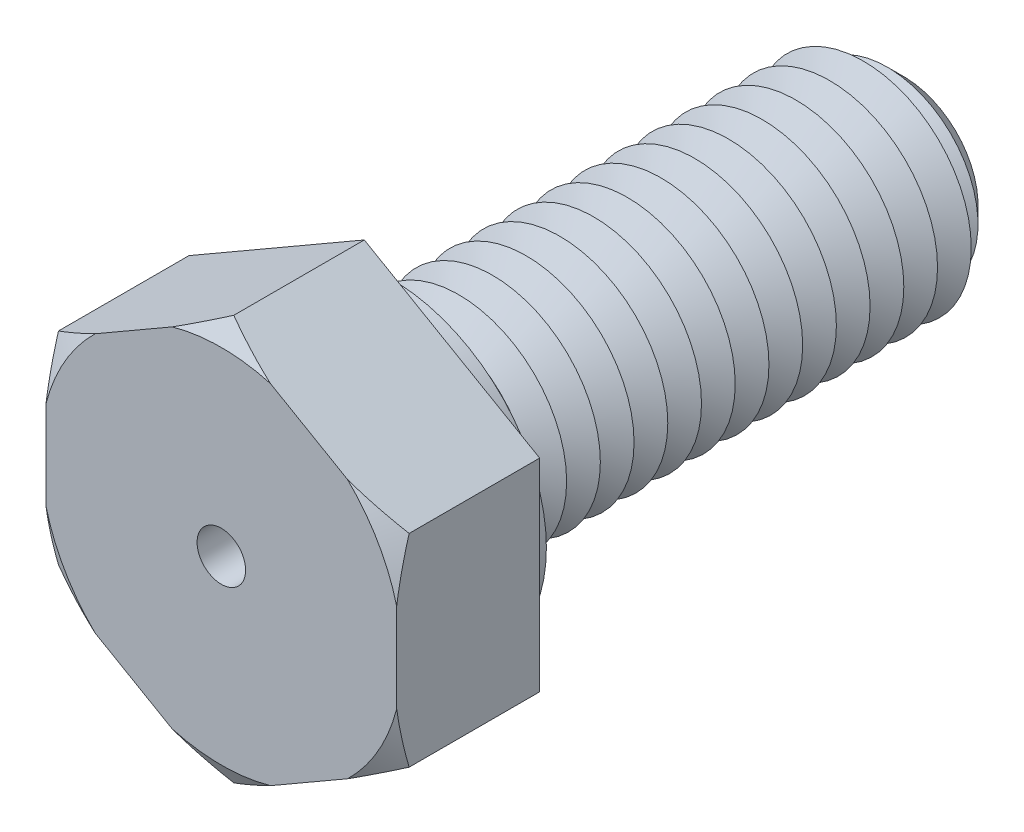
ISO-10303-21;
HEADER;
FILE_DESCRIPTION(('STEP AP214'),'2;1');
FILE_NAME('part.step','',(''),(''),'','','');
FILE_SCHEMA(('AUTOMOTIVE_DESIGN { 1 0 10303 214 1 1 1 1 }'));
ENDSEC;
DATA;
#1=APPLICATION_CONTEXT('core data for automotive mechanical design processes');
#2=APPLICATION_PROTOCOL_DEFINITION('international standard','automotive_design',2000,#1);
#3=PRODUCT_CONTEXT('',#1,'mechanical');
#4=PRODUCT('Part','Part','',(#3));
#5=PRODUCT_RELATED_PRODUCT_CATEGORY('part','',(#4));
#6=PRODUCT_DEFINITION_FORMATION('','',#4);
#7=PRODUCT_DEFINITION_CONTEXT('part definition',#1,'design');
#8=PRODUCT_DEFINITION('design','',#6,#7);
#9=PRODUCT_DEFINITION_SHAPE('','',#8);
#10=(LENGTH_UNIT() NAMED_UNIT(*) SI_UNIT(.MILLI.,.METRE.));
#11=(NAMED_UNIT(*) PLANE_ANGLE_UNIT() SI_UNIT($,.RADIAN.));
#12=(NAMED_UNIT(*) SI_UNIT($,.STERADIAN.) SOLID_ANGLE_UNIT());
#13=UNCERTAINTY_MEASURE_WITH_UNIT(LENGTH_MEASURE(1.E-05),#10,'distance_accuracy_value','');
#14=(GEOMETRIC_REPRESENTATION_CONTEXT(3) GLOBAL_UNCERTAINTY_ASSIGNED_CONTEXT((#13)) GLOBAL_UNIT_ASSIGNED_CONTEXT((#10,
#11,#12)) REPRESENTATION_CONTEXT('',''));
#15=CARTESIAN_POINT('',(0.,0.,0.));
#16=DIRECTION('',(0.,0.,1.));
#17=DIRECTION('',(1.,0.,0.));
#18=AXIS2_PLACEMENT_3D('',#15,#16,#17);
#19=CARTESIAN_POINT('',(6.5,3.75277674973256,5.3));
#20=DIRECTION('',(-0.5,-0.866025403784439,0.));
#21=DIRECTION('',(0.866025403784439,-0.5,0.));
#22=AXIS2_PLACEMENT_3D('',#19,#20,#21);
#23=PLANE('',#22);
#24=CARTESIAN_POINT('',(11.0120510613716,1.14774285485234,2.77920306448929));
#25=CARTESIAN_POINT('',(10.8078344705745,1.26564735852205,2.88939185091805));
#26=CARTESIAN_POINT('',(10.6031290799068,1.38383407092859,2.99839128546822));
#27=CARTESIAN_POINT('',(10.1925345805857,1.6208909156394,3.21345290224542));
#28=CARTESIAN_POINT('',(9.98664532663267,1.73976113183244,3.31951471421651));
#29=CARTESIAN_POINT('',(9.57286478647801,1.97865743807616,3.52844955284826));
#30=CARTESIAN_POINT('',(9.36496919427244,2.09868601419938,3.63131124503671));
#31=CARTESIAN_POINT('',(8.9476201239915,2.33964261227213,3.83272114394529));
#32=CARTESIAN_POINT('',(8.73816669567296,2.46057060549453,3.93126948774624));
#33=CARTESIAN_POINT('',(8.31210847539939,2.70655543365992,4.12554493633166));
#34=CARTESIAN_POINT('',(8.0954571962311,2.83163910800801,4.22113674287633));
#35=CARTESIAN_POINT('',(7.65996896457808,3.0830683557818,4.40550790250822));
#36=CARTESIAN_POINT('',(7.44113190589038,3.2094139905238,4.49428692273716));
#37=CARTESIAN_POINT('',(7.00122142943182,3.46339642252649,4.66334180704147));
#38=CARTESIAN_POINT('',(6.78015039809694,3.59103184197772,4.74362587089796));
#39=CARTESIAN_POINT('',(6.3354128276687,3.8478011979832,4.89383693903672));
#40=CARTESIAN_POINT('',(6.11174662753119,3.97693493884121,4.96376527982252));
#41=CARTESIAN_POINT('',(5.57683009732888,4.2857691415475,5.11501441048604));
#42=CARTESIAN_POINT('',(5.26433342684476,4.46618917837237,5.19069976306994));
#43=CARTESIAN_POINT('',(4.79238520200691,4.73866861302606,5.28165255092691));
#44=CARTESIAN_POINT('',(4.63453792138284,4.82980178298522,5.30820735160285));
#45=CARTESIAN_POINT('',(4.31797843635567,5.01256748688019,5.35312391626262));
#46=CARTESIAN_POINT('',(4.15926635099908,5.10419995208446,5.37148678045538));
#47=CARTESIAN_POINT('',(3.84309853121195,5.28673952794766,5.3993333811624));
#48=CARTESIAN_POINT('',(3.68564943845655,5.37764280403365,5.40891715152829));
#49=CARTESIAN_POINT('',(3.37053331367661,5.55957518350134,5.41928234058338));
#50=CARTESIAN_POINT('',(3.21286628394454,5.65060428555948,5.42006385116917));
#51=CARTESIAN_POINT('',(2.89768626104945,5.83257355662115,5.4127996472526));
#52=CARTESIAN_POINT('',(2.74017326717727,5.92351372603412,5.40475397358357));
#53=CARTESIAN_POINT('',(2.42563627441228,6.10511174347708,5.38007889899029));
#54=CARTESIAN_POINT('',(2.26861235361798,6.19576954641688,5.36344819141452));
#55=CARTESIAN_POINT('',(1.8976455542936,6.40994732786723,5.31443879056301));
#56=CARTESIAN_POINT('',(1.6840512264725,6.53326607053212,5.27851525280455));
#57=CARTESIAN_POINT('',(1.25890710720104,6.77872314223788,5.19313397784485));
#58=CARTESIAN_POINT('',(1.04735761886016,6.90086129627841,5.14367426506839));
#59=CARTESIAN_POINT('',(0.626329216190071,7.14394215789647,5.03308780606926));
#60=CARTESIAN_POINT('',(0.416852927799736,7.26488334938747,4.97194786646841));
#61=CARTESIAN_POINT('',(0.000251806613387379,7.50540811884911,4.83992704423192));
#62=CARTESIAN_POINT('',(-0.206873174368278,7.62499178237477,4.76904677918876));
#63=CARTESIAN_POINT('',(-0.621367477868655,7.86430018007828,4.61833709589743));
#64=CARTESIAN_POINT('',(-0.828710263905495,7.98400959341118,4.53841104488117));
#65=CARTESIAN_POINT('',(-1.2411992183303,8.22216020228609,4.3718486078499));
#66=CARTESIAN_POINT('',(-1.44634674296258,8.34060218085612,4.2852166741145));
#67=CARTESIAN_POINT('',(-1.85477207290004,8.57640665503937,4.10643213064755));
#68=CARTESIAN_POINT('',(-2.05805026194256,8.69376937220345,4.01428068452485));
#69=CARTESIAN_POINT('',(-2.46301289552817,8.92757465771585,3.82542322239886));
#70=CARTESIAN_POINT('',(-2.66469731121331,9.04401720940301,3.72871712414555));
#71=CARTESIAN_POINT('',(-3.00477721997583,9.24036243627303,3.56190249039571));
#72=CARTESIAN_POINT('',(-3.14353507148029,9.32047431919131,3.49277477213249));
#73=CARTESIAN_POINT('',(-3.42044427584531,9.48034792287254,3.35293264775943));
#74=CARTESIAN_POINT('',(-3.55859564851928,9.56010965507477,3.28221829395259));
#75=CARTESIAN_POINT('',(-3.83290330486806,9.71848125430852,3.14014092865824));
#76=CARTESIAN_POINT('',(-3.96906528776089,9.79709441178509,3.06879256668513));
#77=CARTESIAN_POINT('',(-4.24090766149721,9.9540426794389,2.92487520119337));
#78=CARTESIAN_POINT('',(-4.37658804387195,10.0323777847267,2.85230617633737));
#79=CARTESIAN_POINT('',(-4.5120510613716,10.1105873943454,2.77920306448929));
#80=B_SPLINE_CURVE_WITH_KNOTS('',3,(#24,#25,#26,#27,#28,#29,#30,#31,#32,#33,#34,#35,#36,#37,#38,
#39,#40,#41,#42,#43,#44,#45,#46,#47,#48,#49,#50,#51,#52,#53,#54,#55,#56,#57,#58,#59,#60,#61,#62,
#63,#64,#65,#66,#67,#68,#69,#70,#71,#72,#73,#74,#75,#76,#77,#78,#79),.UNSPECIFIED.,.F.,.F.,(4,2,
2,2,2,2,2,2,2,2,2,2,2,2,2,2,2,2,2,2,2,2,2,2,2,2,2,4),(0.,0.780858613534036,1.56181520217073,
2.34527979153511,3.12871946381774,3.93206444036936,4.73544864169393,5.53805016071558,
6.34054800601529,7.44542333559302,7.99784254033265,8.55018753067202,9.096157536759,
9.64212184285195,10.1880836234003,10.7341285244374,11.4813961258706,12.2287728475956,
12.9769988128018,13.7251773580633,14.4822772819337,15.2388787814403,15.9953213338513,
16.7517775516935,17.2752695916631,17.7987444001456,18.3167123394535,18.8346893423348),.UNSPECIFIED.);
#81=CARTESIAN_POINT('',(6.5,3.75277674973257,4.83811978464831));
#82=VERTEX_POINT('',#81);
#83=CARTESIAN_POINT('',(4.67682717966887,4.80538606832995,5.3));
#84=VERTEX_POINT('',#83);
#85=EDGE_CURVE('E132',#82,#84,#80,.T.);
#86=ORIENTED_EDGE('',*,*,#85,.F.);
#87=DIRECTION('',(0.,0.,-1.));
#88=VECTOR('',#87,1.);
#89=CARTESIAN_POINT('',(6.5,3.75277674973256,5.3));
#90=LINE('',#89,#88);
#91=CARTESIAN_POINT('',(6.5,3.75277674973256,0.));
#92=VERTEX_POINT('',#91);
#93=EDGE_CURVE('E144',#82,#92,#90,.T.);
#94=ORIENTED_EDGE('',*,*,#93,.T.);
#95=DIRECTION('',(-0.866025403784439,0.5,0.));
#96=VECTOR('',#95,1.);
#97=CARTESIAN_POINT('',(6.5,3.75277674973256,0.));
#98=LINE('',#97,#96);
#99=CARTESIAN_POINT('',(0.,7.50555349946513,0.));
#100=VERTEX_POINT('',#99);
#101=EDGE_CURVE('E322',#92,#100,#98,.T.);
#102=ORIENTED_EDGE('',*,*,#101,.T.);
#103=DIRECTION('',(0.,0.,-1.));
#104=VECTOR('',#103,1.);
#105=CARTESIAN_POINT('',(0.,7.50555349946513,5.3));
#106=LINE('',#105,#104);
#107=CARTESIAN_POINT('',(0.,7.50555349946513,4.83811978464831));
#108=VERTEX_POINT('',#107);
#109=EDGE_CURVE('E179',#108,#100,#106,.T.);
#110=ORIENTED_EDGE('',*,*,#109,.F.);
#111=CARTESIAN_POINT('',(1.82317282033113,6.45294418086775,5.3));
#112=VERTEX_POINT('',#111);
#113=EDGE_CURVE('E151',#112,#108,#80,.T.);
#114=ORIENTED_EDGE('',*,*,#113,.F.);
#115=DIRECTION('',(-0.866025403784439,0.5,0.));
#116=VECTOR('',#115,1.);
#117=CARTESIAN_POINT('',(6.5,3.75277674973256,5.3));
#118=LINE('',#117,#116);
#119=EDGE_CURVE('E148',#84,#112,#118,.T.);
#120=ORIENTED_EDGE('',*,*,#119,.F.);
#121=EDGE_LOOP('',(#86,#94,#102,#110,#114,#120));
#122=FACE_BOUND('',#121,.T.);
#123=ADVANCED_FACE('F39',(#122),#23,.F.);
#124=CARTESIAN_POINT('',(0.,7.50555349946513,5.3));
#125=DIRECTION('',(0.5,-0.866025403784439,0.));
#126=DIRECTION('',(0.866025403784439,0.5,0.));
#127=AXIS2_PLACEMENT_3D('',#124,#125,#126);
#128=PLANE('',#127);
#129=CARTESIAN_POINT('',(4.5120510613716,10.1105873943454,2.77920306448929));
#130=CARTESIAN_POINT('',(4.30783447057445,9.99268289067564,2.88939185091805));
#131=CARTESIAN_POINT('',(4.1031290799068,9.87449617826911,2.99839128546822));
#132=CARTESIAN_POINT('',(3.69253458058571,9.63743933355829,3.21345290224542));
#133=CARTESIAN_POINT('',(3.48664532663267,9.51856911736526,3.31951471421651));
#134=CARTESIAN_POINT('',(3.07286478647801,9.27967281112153,3.52844955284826));
#135=CARTESIAN_POINT('',(2.86496919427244,9.15964423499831,3.63131124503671));
#136=CARTESIAN_POINT('',(2.4476201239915,8.91868763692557,3.83272114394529));
#137=CARTESIAN_POINT('',(2.23816669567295,8.79775964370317,3.93126948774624));
#138=CARTESIAN_POINT('',(1.81210847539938,8.55177481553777,4.12554493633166));
#139=CARTESIAN_POINT('',(1.5954571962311,8.42669114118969,4.22113674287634));
#140=CARTESIAN_POINT('',(1.15996896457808,8.1752618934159,4.40550790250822));
#141=CARTESIAN_POINT('',(0.941131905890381,8.04891625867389,4.49428692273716));
#142=CARTESIAN_POINT('',(0.501221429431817,7.7949338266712,4.66334180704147));
#143=CARTESIAN_POINT('',(0.280150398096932,7.66729840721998,4.74362587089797));
#144=CARTESIAN_POINT('',(-0.164587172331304,7.4105290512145,4.89383693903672));
#145=CARTESIAN_POINT('',(-0.388253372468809,7.28139531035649,4.96376527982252));
#146=CARTESIAN_POINT('',(-0.923169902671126,6.9725611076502,5.11501441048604));
#147=CARTESIAN_POINT('',(-1.23566657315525,6.79214107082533,5.19069976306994));
#148=CARTESIAN_POINT('',(-1.70761479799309,6.51966163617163,5.28165255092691));
#149=CARTESIAN_POINT('',(-1.86546207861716,6.42852846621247,5.30820735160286));
#150=CARTESIAN_POINT('',(-2.18202156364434,6.24576276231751,5.35312391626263));
#151=CARTESIAN_POINT('',(-2.34073364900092,6.15413029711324,5.37148678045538));
#152=CARTESIAN_POINT('',(-2.65690146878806,5.97159072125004,5.3993333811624));
#153=CARTESIAN_POINT('',(-2.81435056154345,5.88068744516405,5.40891715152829));
#154=CARTESIAN_POINT('',(-3.12946668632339,5.69875506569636,5.41928234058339));
#155=CARTESIAN_POINT('',(-3.28713371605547,5.60772596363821,5.42006385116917));
#156=CARTESIAN_POINT('',(-3.60231373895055,5.42575669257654,5.4127996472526));
#157=CARTESIAN_POINT('',(-3.75982673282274,5.33481652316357,5.40475397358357));
#158=CARTESIAN_POINT('',(-4.07436372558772,5.15321850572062,5.38007889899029));
#159=CARTESIAN_POINT('',(-4.23138764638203,5.06256070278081,5.36344819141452));
#160=CARTESIAN_POINT('',(-4.60235444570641,4.84838292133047,5.31443879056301));
#161=CARTESIAN_POINT('',(-4.81594877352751,4.72506417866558,5.27851525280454));
#162=CARTESIAN_POINT('',(-5.24109289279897,4.47960710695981,5.19313397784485));
#163=CARTESIAN_POINT('',(-5.45264238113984,4.35746895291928,5.14367426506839));
#164=CARTESIAN_POINT('',(-5.87367078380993,4.11438809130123,5.03308780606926));
#165=CARTESIAN_POINT('',(-6.08314707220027,3.99344689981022,4.97194786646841));
#166=CARTESIAN_POINT('',(-6.49974819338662,3.75292213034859,4.83992704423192));
#167=CARTESIAN_POINT('',(-6.70687317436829,3.63333846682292,4.76904677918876));
#168=CARTESIAN_POINT('',(-7.12136747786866,3.39403006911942,4.61833709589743));
#169=CARTESIAN_POINT('',(-7.3287102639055,3.27432065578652,4.53841104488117));
#170=CARTESIAN_POINT('',(-7.74119921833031,3.03617004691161,4.3718486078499));
#171=CARTESIAN_POINT('',(-7.94634674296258,2.91772806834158,4.2852166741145));
#172=CARTESIAN_POINT('',(-8.35477207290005,2.68192359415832,4.10643213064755));
#173=CARTESIAN_POINT('',(-8.55805026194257,2.56456087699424,4.01428068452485));
#174=CARTESIAN_POINT('',(-8.96301289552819,2.33075559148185,3.82542322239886));
#175=CARTESIAN_POINT('',(-9.16469731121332,2.21431303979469,3.72871712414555));
#176=CARTESIAN_POINT('',(-9.50477721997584,2.01796781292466,3.5619024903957));
#177=CARTESIAN_POINT('',(-9.6435350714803,1.93785593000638,3.49277477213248));
#178=CARTESIAN_POINT('',(-9.92044427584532,1.77798232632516,3.35293264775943));
#179=CARTESIAN_POINT('',(-10.0585956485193,1.69822059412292,3.28221829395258));
#180=CARTESIAN_POINT('',(-10.3329033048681,1.53984899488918,3.14014092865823));
#181=CARTESIAN_POINT('',(-10.4690652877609,1.46123583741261,3.06879256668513));
#182=CARTESIAN_POINT('',(-10.7409076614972,1.3042875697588,2.92487520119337));
#183=CARTESIAN_POINT('',(-10.876588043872,1.225952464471,2.85230617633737));
#184=CARTESIAN_POINT('',(-11.0120510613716,1.14774285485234,2.77920306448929));
#185=B_SPLINE_CURVE_WITH_KNOTS('',3,(#129,#130,#131,#132,#133,#134,#135,#136,#137,#138,#139,
#140,#141,#142,#143,#144,#145,#146,#147,#148,#149,#150,#151,#152,#153,#154,#155,#156,#157,#158,
#159,#160,#161,#162,#163,#164,#165,#166,#167,#168,#169,#170,#171,#172,#173,#174,#175,#176,#177,
#178,#179,#180,#181,#182,#183,#184),.UNSPECIFIED.,.F.,.F.,(4,2,2,2,2,2,2,2,2,2,2,2,2,2,2,2,2,2,
2,2,2,2,2,2,2,2,2,4),(0.,0.780858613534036,1.56181520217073,2.34527979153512,3.12871946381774,
3.93206444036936,4.73544864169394,5.53805016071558,6.34054800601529,7.44542333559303,
7.99784254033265,8.55018753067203,9.096157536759,9.64212184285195,10.1880836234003,
10.7341285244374,11.4813961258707,12.2287728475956,12.9769988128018,13.7251773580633,
14.4822772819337,15.2388787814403,15.9953213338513,16.7517775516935,17.2752695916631,
17.7987444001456,18.3167123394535,18.8346893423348),.UNSPECIFIED.);
#186=CARTESIAN_POINT('',(-1.82317282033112,6.45294418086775,5.3));
#187=VERTEX_POINT('',#186);
#188=EDGE_CURVE('E459',#108,#187,#185,.T.);
#189=ORIENTED_EDGE('',*,*,#188,.F.);
#190=ORIENTED_EDGE('',*,*,#109,.T.);
#191=DIRECTION('',(-0.866025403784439,-0.5,0.));
#192=VECTOR('',#191,1.);
#193=CARTESIAN_POINT('',(0.,7.50555349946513,0.));
#194=LINE('',#193,#192);
#195=CARTESIAN_POINT('',(-6.5,3.75277674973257,0.));
#196=VERTEX_POINT('',#195);
#197=EDGE_CURVE('E342',#100,#196,#194,.T.);
#198=ORIENTED_EDGE('',*,*,#197,.T.);
#199=DIRECTION('',(0.,0.,-1.));
#200=VECTOR('',#199,1.);
#201=CARTESIAN_POINT('',(-6.5,3.75277674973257,5.3));
#202=LINE('',#201,#200);
#203=CARTESIAN_POINT('',(-6.5,3.75277674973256,4.83811978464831));
#204=VERTEX_POINT('',#203);
#205=EDGE_CURVE('E176',#204,#196,#202,.T.);
#206=ORIENTED_EDGE('',*,*,#205,.F.);
#207=CARTESIAN_POINT('',(-4.67682717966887,4.80538606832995,5.3));
#208=VERTEX_POINT('',#207);
#209=EDGE_CURVE('E389',#208,#204,#185,.T.);
#210=ORIENTED_EDGE('',*,*,#209,.F.);
#211=DIRECTION('',(-0.866025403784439,-0.5,0.));
#212=VECTOR('',#211,1.);
#213=CARTESIAN_POINT('',(0.,7.50555349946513,5.3));
#214=LINE('',#213,#212);
#215=EDGE_CURVE('E325',#187,#208,#214,.T.);
#216=ORIENTED_EDGE('',*,*,#215,.F.);
#217=EDGE_LOOP('',(#189,#190,#198,#206,#210,#216));
#218=FACE_BOUND('',#217,.T.);
#219=ADVANCED_FACE('F448',(#218),#128,.F.);
#220=CARTESIAN_POINT('',(-6.5,3.75277674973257,5.3));
#221=DIRECTION('',(1.,0.,0.));
#222=DIRECTION('',(0.,0.,-1.));
#223=AXIS2_PLACEMENT_3D('',#220,#221,#222);
#224=PLANE('',#223);
#225=CARTESIAN_POINT('',(-6.5,8.26482781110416,3.10083044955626));
#226=CARTESIAN_POINT('',(-6.5,8.03000458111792,3.20736842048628));
#227=CARTESIAN_POINT('',(-6.5,7.79453887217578,3.31251727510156));
#228=CARTESIAN_POINT('',(-6.5,7.32204728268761,3.51936269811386));
#229=CARTESIAN_POINT('',(-6.5,7.08502112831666,3.62105864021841));
#230=CARTESIAN_POINT('',(-6.5,6.6082238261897,3.82070151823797));
#231=CARTESIAN_POINT('',(-6.5,6.36844534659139,3.91863101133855));
#232=CARTESIAN_POINT('',(-6.5,5.88686103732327,4.10935828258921));
#233=CARTESIAN_POINT('',(-6.5,5.64505530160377,4.20215629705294));
#234=CARTESIAN_POINT('',(-6.5,5.16020806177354,4.38107583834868));
#235=CARTESIAN_POINT('',(-6.5,4.91717698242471,4.46722547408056));
#236=CARTESIAN_POINT('',(-6.5,4.42851680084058,4.63190822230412));
#237=CARTESIAN_POINT('',(-6.5,4.18288757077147,4.71044095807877));
#238=CARTESIAN_POINT('',(-6.5,3.68915983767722,4.85808723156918));
#239=CARTESIAN_POINT('',(-6.5,3.44106517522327,4.9272135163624));
#240=CARTESIAN_POINT('',(-6.5,2.94198131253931,5.05420795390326));
#241=CARTESIAN_POINT('',(-6.5,2.69099223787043,5.1120765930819));
#242=CARTESIAN_POINT('',(-6.5,2.25769005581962,5.19995201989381));
#243=CARTESIAN_POINT('',(-6.5,2.07603591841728,5.23320954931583));
#244=CARTESIAN_POINT('',(-6.5,1.71151122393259,5.29207741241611));
#245=CARTESIAN_POINT('',(-6.5,1.52864087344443,5.31768901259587));
#246=CARTESIAN_POINT('',(-6.5,1.16195360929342,5.36059506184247));
#247=CARTESIAN_POINT('',(-6.5,0.978136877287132,5.37789105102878));
#248=CARTESIAN_POINT('',(-6.5,0.609880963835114,5.40367049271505));
#249=CARTESIAN_POINT('',(-6.5,0.425441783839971,5.41215396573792));
#250=CARTESIAN_POINT('',(-6.5,0.0564612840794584,5.42004368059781));
#251=CARTESIAN_POINT('',(-6.5,-0.128079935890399,5.41945454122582));
#252=CARTESIAN_POINT('',(-6.5,-0.49690745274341,5.40922941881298));
#253=CARTESIAN_POINT('',(-6.5,-0.681193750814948,5.39959347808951));
#254=CARTESIAN_POINT('',(-6.5,-1.04910266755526,5.37156866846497));
#255=CARTESIAN_POINT('',(-6.5,-1.23272526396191,5.35317950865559));
#256=CARTESIAN_POINT('',(-6.5,-1.5989735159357,5.30817918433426));
#257=CARTESIAN_POINT('',(-6.5,-1.78159898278,5.28156651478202));
#258=CARTESIAN_POINT('',(-6.5,-2.5090476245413,5.16009602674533));
#259=CARTESIAN_POINT('',(-6.5,-3.04897729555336,5.0350728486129));
#260=CARTESIAN_POINT('',(-6.5,-3.8489021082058,4.8122065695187));
#261=CARTESIAN_POINT('',(-6.5,-4.11422810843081,4.73189887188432));
#262=CARTESIAN_POINT('',(-6.5,-4.64182213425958,4.5617271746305));
#263=CARTESIAN_POINT('',(-6.5,-4.90409037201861,4.47186384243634));
#264=CARTESIAN_POINT('',(-6.5,-5.42881258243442,4.28339622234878));
#265=CARTESIAN_POINT('',(-6.5,-5.69123450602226,4.18470387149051));
#266=CARTESIAN_POINT('',(-6.5,-6.21363007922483,3.98100889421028));
#267=CARTESIAN_POINT('',(-6.5,-6.4736035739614,3.87600587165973));
#268=CARTESIAN_POINT('',(-6.5,-6.98982707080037,3.66159357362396));
#269=CARTESIAN_POINT('',(-6.5,-7.24609016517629,3.55221565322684));
#270=CARTESIAN_POINT('',(-6.5,-7.75676014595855,3.32937132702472));
#271=CARTESIAN_POINT('',(-6.5,-8.0111674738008,3.21590593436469));
#272=CARTESIAN_POINT('',(-6.5,-8.26482781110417,3.10083044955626));
#273=B_SPLINE_CURVE_WITH_KNOTS('',3,(#225,#226,#227,#228,#229,#230,#231,#232,#233,#234,#235,
#236,#237,#238,#239,#240,#241,#242,#243,#244,#245,#246,#247,#248,#249,#250,#251,#252,#253,#254,
#255,#256,#257,#258,#259,#260,#261,#262,#263,#264,#265,#266,#267,#268,#269,#270,#271,#272),
.UNSPECIFIED.,.F.,.F.,(4,2,2,2,2,2,2,2,2,2,2,2,2,2,2,2,2,2,2,2,2,2,2,4),(0.,0.773595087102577,
1.54732974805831,2.3242977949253,3.10123003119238,3.87467353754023,4.64815527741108,
5.42057817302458,6.19296768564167,6.74684672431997,7.30063396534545,7.85431860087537,
8.40800194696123,8.96140342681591,9.51480231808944,10.0682196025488,10.621738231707,
12.2804682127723,13.1120468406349,13.9435674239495,14.7845791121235,15.625643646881,
16.4614935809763,17.2971377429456),.UNSPECIFIED.);
#274=CARTESIAN_POINT('',(-6.5,1.64755811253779,5.3));
#275=VERTEX_POINT('',#274);
#276=EDGE_CURVE('E380',#204,#275,#273,.T.);
#277=ORIENTED_EDGE('',*,*,#276,.F.);
#278=ORIENTED_EDGE('',*,*,#205,.T.);
#279=DIRECTION('',(0.,-1.,0.));
#280=VECTOR('',#279,1.);
#281=CARTESIAN_POINT('',(-6.5,3.75277674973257,0.));
#282=LINE('',#281,#280);
#283=CARTESIAN_POINT('',(-6.5,-3.75277674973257,0.));
#284=VERTEX_POINT('',#283);
#285=EDGE_CURVE('E345',#196,#284,#282,.T.);
#286=ORIENTED_EDGE('',*,*,#285,.T.);
#287=DIRECTION('',(0.,0.,-1.));
#288=VECTOR('',#287,1.);
#289=CARTESIAN_POINT('',(-6.5,-3.75277674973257,5.3));
#290=LINE('',#289,#288);
#291=CARTESIAN_POINT('',(-6.49999999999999,-3.75277674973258,4.83811978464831));
#292=VERTEX_POINT('',#291);
#293=EDGE_CURVE('E173',#292,#284,#290,.T.);
#294=ORIENTED_EDGE('',*,*,#293,.F.);
#295=CARTESIAN_POINT('',(-6.5,-1.64755811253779,5.3));
#296=VERTEX_POINT('',#295);
#297=EDGE_CURVE('E383',#296,#292,#273,.T.);
#298=ORIENTED_EDGE('',*,*,#297,.F.);
#299=DIRECTION('',(0.,-1.,0.));
#300=VECTOR('',#299,1.);
#301=CARTESIAN_POINT('',(-6.5,3.75277674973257,5.3));
#302=LINE('',#301,#300);
#303=EDGE_CURVE('E329',#275,#296,#302,.T.);
#304=ORIENTED_EDGE('',*,*,#303,.F.);
#305=EDGE_LOOP('',(#277,#278,#286,#294,#298,#304));
#306=FACE_BOUND('',#305,.T.);
#307=ADVANCED_FACE('F379',(#306),#224,.F.);
#308=CARTESIAN_POINT('',(-6.5,-3.75277674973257,5.3));
#309=DIRECTION('',(0.5,0.866025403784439,0.));
#310=DIRECTION('',(-0.866025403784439,0.5,0.));
#311=AXIS2_PLACEMENT_3D('',#308,#309,#310);
#312=PLANE('',#311);
#313=CARTESIAN_POINT('',(-11.0120510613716,-1.14774285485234,2.77920306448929));
#314=CARTESIAN_POINT('',(-10.8078344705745,-1.26564735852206,2.88939185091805));
#315=CARTESIAN_POINT('',(-10.6031290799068,-1.3838340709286,2.99839128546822));
#316=CARTESIAN_POINT('',(-10.1925345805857,-1.62089091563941,3.21345290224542));
#317=CARTESIAN_POINT('',(-9.98664532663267,-1.73976113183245,3.31951471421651));
#318=CARTESIAN_POINT('',(-9.572864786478,-1.97865743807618,3.52844955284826));
#319=CARTESIAN_POINT('',(-9.36496919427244,-2.09868601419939,3.63131124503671));
#320=CARTESIAN_POINT('',(-8.94762012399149,-2.33964261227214,3.83272114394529));
#321=CARTESIAN_POINT('',(-8.73816669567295,-2.46057060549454,3.93126948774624));
#322=CARTESIAN_POINT('',(-8.31210847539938,-2.70655543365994,4.12554493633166));
#323=CARTESIAN_POINT('',(-8.0954571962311,-2.83163910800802,4.22113674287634));
#324=CARTESIAN_POINT('',(-7.65996896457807,-3.08306835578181,4.40550790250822));
#325=CARTESIAN_POINT('',(-7.44113190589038,-3.20941399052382,4.49428692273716));
#326=CARTESIAN_POINT('',(-7.00122142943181,-3.46339642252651,4.66334180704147));
#327=CARTESIAN_POINT('',(-6.78015039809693,-3.59103184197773,4.74362587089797));
#328=CARTESIAN_POINT('',(-6.33541282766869,-3.84780119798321,4.89383693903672));
#329=CARTESIAN_POINT('',(-6.11174662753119,-3.97693493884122,4.96376527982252));
#330=CARTESIAN_POINT('',(-5.57683009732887,-4.28576914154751,5.11501441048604));
#331=CARTESIAN_POINT('',(-5.26433342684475,-4.46618917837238,5.19069976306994));
#332=CARTESIAN_POINT('',(-4.7923852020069,-4.73866861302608,5.28165255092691));
#333=CARTESIAN_POINT('',(-4.63453792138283,-4.82980178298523,5.30820735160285));
#334=CARTESIAN_POINT('',(-4.31797843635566,-5.0125674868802,5.35312391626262));
#335=CARTESIAN_POINT('',(-4.15926635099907,-5.10419995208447,5.37148678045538));
#336=CARTESIAN_POINT('',(-3.84309853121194,-5.28673952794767,5.39933338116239));
#337=CARTESIAN_POINT('',(-3.68564943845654,-5.37764280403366,5.40891715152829));
#338=CARTESIAN_POINT('',(-3.3705333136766,-5.55957518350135,5.41928234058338));
#339=CARTESIAN_POINT('',(-3.21286628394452,-5.6506042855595,5.42006385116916));
#340=CARTESIAN_POINT('',(-2.89768626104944,-5.83257355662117,5.41279964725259));
#341=CARTESIAN_POINT('',(-2.74017326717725,-5.92351372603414,5.40475397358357));
#342=CARTESIAN_POINT('',(-2.42563627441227,-6.1051117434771,5.38007889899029));
#343=CARTESIAN_POINT('',(-2.26861235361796,-6.1957695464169,5.36344819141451));
#344=CARTESIAN_POINT('',(-1.89764555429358,-6.40994732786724,5.314438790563));
#345=CARTESIAN_POINT('',(-1.68405122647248,-6.53326607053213,5.27851525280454));
#346=CARTESIAN_POINT('',(-1.25890710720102,-6.7787231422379,5.19313397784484));
#347=CARTESIAN_POINT('',(-1.04735761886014,-6.90086129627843,5.14367426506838));
#348=CARTESIAN_POINT('',(-0.626329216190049,-7.14394215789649,5.03308780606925));
#349=CARTESIAN_POINT('',(-0.416852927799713,-7.26488334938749,4.9719478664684));
#350=CARTESIAN_POINT('',(-0.000251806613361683,-7.50540811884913,4.83992704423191));
#351=CARTESIAN_POINT('',(0.206873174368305,-7.62499178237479,4.76904677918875));
#352=CARTESIAN_POINT('',(0.621367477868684,-7.8643001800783,4.61833709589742));
#353=CARTESIAN_POINT('',(0.828710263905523,-7.9840095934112,4.53841104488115));
#354=CARTESIAN_POINT('',(1.24119921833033,-8.22216020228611,4.37184860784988));
#355=CARTESIAN_POINT('',(1.44634674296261,-8.34060218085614,4.28521667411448));
#356=CARTESIAN_POINT('',(1.85477207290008,-8.5764066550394,4.10643213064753));
#357=CARTESIAN_POINT('',(2.0580502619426,-8.69376937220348,4.01428068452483));
#358=CARTESIAN_POINT('',(2.46301289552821,-8.92757465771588,3.82542322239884));
#359=CARTESIAN_POINT('',(2.66469731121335,-9.04401720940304,3.72871712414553));
#360=CARTESIAN_POINT('',(3.00477721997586,-9.24036243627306,3.56190249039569));
#361=CARTESIAN_POINT('',(3.14353507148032,-9.32047431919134,3.49277477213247));
#362=CARTESIAN_POINT('',(3.42044427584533,-9.48034792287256,3.35293264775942));
#363=CARTESIAN_POINT('',(3.55859564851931,-9.56010965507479,3.28221829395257));
#364=CARTESIAN_POINT('',(3.83290330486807,-9.71848125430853,3.14014092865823));
#365=CARTESIAN_POINT('',(3.9690652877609,-9.7970944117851,3.06879256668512));
#366=CARTESIAN_POINT('',(4.24090766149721,-9.9540426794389,2.92487520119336));
#367=CARTESIAN_POINT('',(4.37658804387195,-10.0323777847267,2.85230617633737));
#368=CARTESIAN_POINT('',(4.51205106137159,-10.1105873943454,2.77920306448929));
#369=B_SPLINE_CURVE_WITH_KNOTS('',3,(#313,#314,#315,#316,#317,#318,#319,#320,#321,#322,#323,
#324,#325,#326,#327,#328,#329,#330,#331,#332,#333,#334,#335,#336,#337,#338,#339,#340,#341,#342,
#343,#344,#345,#346,#347,#348,#349,#350,#351,#352,#353,#354,#355,#356,#357,#358,#359,#360,#361,
#362,#363,#364,#365,#366,#367,#368),.UNSPECIFIED.,.F.,.F.,(4,2,2,2,2,2,2,2,2,2,2,2,2,2,2,2,2,2,
2,2,2,2,2,2,2,2,2,4),(0.,0.780858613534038,1.56181520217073,2.34527979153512,3.12871946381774,
3.93206444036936,4.73544864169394,5.53805016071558,6.3405480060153,7.44542333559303,
7.99784254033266,8.55018753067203,9.09615753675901,9.64212184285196,10.1880836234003,
10.7341285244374,11.4813961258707,12.2287728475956,12.9769988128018,13.7251773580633,
14.4822772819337,15.2388787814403,15.9953213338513,16.7517775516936,17.2752695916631,
17.7987444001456,18.3167123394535,18.8346893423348),.UNSPECIFIED.);
#370=CARTESIAN_POINT('',(-4.67682717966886,-4.80538606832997,5.3));
#371=VERTEX_POINT('',#370);
#372=EDGE_CURVE('E386',#292,#371,#369,.T.);
#373=ORIENTED_EDGE('',*,*,#372,.F.);
#374=ORIENTED_EDGE('',*,*,#293,.T.);
#375=DIRECTION('',(0.866025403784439,-0.5,0.));
#376=VECTOR('',#375,1.);
#377=CARTESIAN_POINT('',(-6.5,-3.75277674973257,0.));
#378=LINE('',#377,#376);
#379=CARTESIAN_POINT('',(0.,-7.50555349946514,0.));
#380=VERTEX_POINT('',#379);
#381=EDGE_CURVE('E348',#284,#380,#378,.T.);
#382=ORIENTED_EDGE('',*,*,#381,.T.);
#383=DIRECTION('',(0.,0.,-1.));
#384=VECTOR('',#383,1.);
#385=CARTESIAN_POINT('',(0.,-7.50555349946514,5.3));
#386=LINE('',#385,#384);
#387=CARTESIAN_POINT('',(0.,-7.50555349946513,4.83811978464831));
#388=VERTEX_POINT('',#387);
#389=EDGE_CURVE('E163',#388,#380,#386,.T.);
#390=ORIENTED_EDGE('',*,*,#389,.F.);
#391=CARTESIAN_POINT('',(-1.82317282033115,-6.45294418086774,5.3));
#392=VERTEX_POINT('',#391);
#393=EDGE_CURVE('E390',#392,#388,#369,.T.);
#394=ORIENTED_EDGE('',*,*,#393,.F.);
#395=DIRECTION('',(0.866025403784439,-0.5,0.));
#396=VECTOR('',#395,1.);
#397=CARTESIAN_POINT('',(-6.5,-3.75277674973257,5.3));
#398=LINE('',#397,#396);
#399=EDGE_CURVE('E333',#371,#392,#398,.T.);
#400=ORIENTED_EDGE('',*,*,#399,.F.);
#401=EDGE_LOOP('',(#373,#374,#382,#390,#394,#400));
#402=FACE_BOUND('',#401,.T.);
#403=ADVANCED_FACE('F439',(#402),#312,.F.);
#404=CARTESIAN_POINT('',(0.,-7.50555349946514,5.3));
#405=DIRECTION('',(-0.5,0.866025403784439,0.));
#406=DIRECTION('',(-0.866025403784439,-0.5,0.));
#407=AXIS2_PLACEMENT_3D('',#404,#405,#406);
#408=PLANE('',#407);
#409=CARTESIAN_POINT('',(-4.5120510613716,-10.1105873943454,2.77920306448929));
#410=CARTESIAN_POINT('',(-4.30783447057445,-9.99268289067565,2.88939185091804));
#411=CARTESIAN_POINT('',(-4.1031290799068,-9.87449617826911,2.99839128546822));
#412=CARTESIAN_POINT('',(-3.69253458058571,-9.6374393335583,3.21345290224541));
#413=CARTESIAN_POINT('',(-3.48664532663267,-9.51856911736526,3.3195147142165));
#414=CARTESIAN_POINT('',(-3.072864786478,-9.27967281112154,3.52844955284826));
#415=CARTESIAN_POINT('',(-2.86496919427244,-9.15964423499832,3.6313112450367));
#416=CARTESIAN_POINT('',(-2.4476201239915,-8.91868763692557,3.83272114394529));
#417=CARTESIAN_POINT('',(-2.23816669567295,-8.79775964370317,3.93126948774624));
#418=CARTESIAN_POINT('',(-1.81210847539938,-8.55177481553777,4.12554493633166));
#419=CARTESIAN_POINT('',(-1.5954571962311,-8.42669114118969,4.22113674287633));
#420=CARTESIAN_POINT('',(-1.15996896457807,-8.1752618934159,4.40550790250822));
#421=CARTESIAN_POINT('',(-0.941131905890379,-8.04891625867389,4.49428692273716));
#422=CARTESIAN_POINT('',(-0.501221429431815,-7.79493382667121,4.66334180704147));
#423=CARTESIAN_POINT('',(-0.28015039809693,-7.66729840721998,4.74362587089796));
#424=CARTESIAN_POINT('',(0.164587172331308,-7.4105290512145,4.89383693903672));
#425=CARTESIAN_POINT('',(0.388253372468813,-7.28139531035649,4.96376527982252));
#426=CARTESIAN_POINT('',(0.92316990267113,-6.9725611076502,5.11501441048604));
#427=CARTESIAN_POINT('',(1.23566657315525,-6.79214107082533,5.19069976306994));
#428=CARTESIAN_POINT('',(1.7076147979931,-6.51966163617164,5.28165255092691));
#429=CARTESIAN_POINT('',(1.86546207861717,-6.42852846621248,5.30820735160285));
#430=CARTESIAN_POINT('',(2.18202156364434,-6.24576276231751,5.35312391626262));
#431=CARTESIAN_POINT('',(2.34073364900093,-6.15413029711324,5.37148678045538));
#432=CARTESIAN_POINT('',(2.65690146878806,-5.97159072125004,5.3993333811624));
#433=CARTESIAN_POINT('',(2.81435056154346,-5.88068744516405,5.40891715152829));
#434=CARTESIAN_POINT('',(3.1294666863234,-5.69875506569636,5.41928234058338));
#435=CARTESIAN_POINT('',(3.28713371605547,-5.60772596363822,5.42006385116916));
#436=CARTESIAN_POINT('',(3.60231373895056,-5.42575669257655,5.41279964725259));
#437=CARTESIAN_POINT('',(3.75982673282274,-5.33481652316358,5.40475397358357));
#438=CARTESIAN_POINT('',(4.07436372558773,-5.15321850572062,5.38007889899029));
#439=CARTESIAN_POINT('',(4.23138764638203,-5.06256070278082,5.36344819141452));
#440=CARTESIAN_POINT('',(4.60235444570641,-4.84838292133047,5.31443879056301));
#441=CARTESIAN_POINT('',(4.81594877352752,-4.72506417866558,5.27851525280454));
#442=CARTESIAN_POINT('',(5.24109289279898,-4.47960710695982,5.19313397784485));
#443=CARTESIAN_POINT('',(5.45264238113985,-4.35746895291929,5.14367426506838));
#444=CARTESIAN_POINT('',(5.87367078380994,-4.11438809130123,5.03308780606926));
#445=CARTESIAN_POINT('',(6.08314707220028,-3.99344689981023,4.9719478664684));
#446=CARTESIAN_POINT('',(6.49974819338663,-3.75292213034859,4.83992704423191));
#447=CARTESIAN_POINT('',(6.7068731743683,-3.63333846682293,4.76904677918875));
#448=CARTESIAN_POINT('',(7.12136747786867,-3.39403006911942,4.61833709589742));
#449=CARTESIAN_POINT('',(7.32871026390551,-3.27432065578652,4.53841104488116));
#450=CARTESIAN_POINT('',(7.74119921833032,-3.03617004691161,4.37184860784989));
#451=CARTESIAN_POINT('',(7.9463467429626,-2.91772806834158,4.28521667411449));
#452=CARTESIAN_POINT('',(8.35477207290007,-2.68192359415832,4.10643213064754));
#453=CARTESIAN_POINT('',(8.55805026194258,-2.56456087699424,4.01428068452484));
#454=CARTESIAN_POINT('',(8.9630128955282,-2.33075559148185,3.82542322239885));
#455=CARTESIAN_POINT('',(9.16469731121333,-2.21431303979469,3.72871712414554));
#456=CARTESIAN_POINT('',(9.50477721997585,-2.01796781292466,3.56190249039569));
#457=CARTESIAN_POINT('',(9.64353507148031,-1.93785593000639,3.49277477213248));
#458=CARTESIAN_POINT('',(9.92044427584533,-1.77798232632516,3.35293264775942));
#459=CARTESIAN_POINT('',(10.0585956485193,-1.69822059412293,3.28221829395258));
#460=CARTESIAN_POINT('',(10.3329033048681,-1.53984899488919,3.14014092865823));
#461=CARTESIAN_POINT('',(10.4690652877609,-1.46123583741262,3.06879256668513));
#462=CARTESIAN_POINT('',(10.7409076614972,-1.30428756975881,2.92487520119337));
#463=CARTESIAN_POINT('',(10.876588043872,-1.22595246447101,2.85230617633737));
#464=CARTESIAN_POINT('',(11.0120510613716,-1.14774285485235,2.77920306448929));
#465=B_SPLINE_CURVE_WITH_KNOTS('',3,(#409,#410,#411,#412,#413,#414,#415,#416,#417,#418,#419,
#420,#421,#422,#423,#424,#425,#426,#427,#428,#429,#430,#431,#432,#433,#434,#435,#436,#437,#438,
#439,#440,#441,#442,#443,#444,#445,#446,#447,#448,#449,#450,#451,#452,#453,#454,#455,#456,#457,
#458,#459,#460,#461,#462,#463,#464),.UNSPECIFIED.,.F.,.F.,(4,2,2,2,2,2,2,2,2,2,2,2,2,2,2,2,2,2,
2,2,2,2,2,2,2,2,2,4),(0.,0.780858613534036,1.56181520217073,2.34527979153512,3.12871946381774,
3.93206444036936,4.73544864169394,5.53805016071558,6.3405480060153,7.44542333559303,
7.99784254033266,8.55018753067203,9.09615753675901,9.64212184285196,10.1880836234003,
10.7341285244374,11.4813961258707,12.2287728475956,12.9769988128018,13.7251773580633,
14.4822772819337,15.2388787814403,15.9953213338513,16.7517775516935,17.2752695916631,
17.7987444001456,18.3167123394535,18.8346893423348),.UNSPECIFIED.);
#466=CARTESIAN_POINT('',(1.82317282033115,-6.45294418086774,5.3));
#467=VERTEX_POINT('',#466);
#468=EDGE_CURVE('E64',#388,#467,#465,.T.);
#469=ORIENTED_EDGE('',*,*,#468,.F.);
#470=ORIENTED_EDGE('',*,*,#389,.T.);
#471=DIRECTION('',(0.866025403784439,0.5,0.));
#472=VECTOR('',#471,1.);
#473=CARTESIAN_POINT('',(0.,-7.50555349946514,0.));
#474=LINE('',#473,#472);
#475=CARTESIAN_POINT('',(6.5,-3.75277674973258,0.));
#476=VERTEX_POINT('',#475);
#477=EDGE_CURVE('E351',#380,#476,#474,.T.);
#478=ORIENTED_EDGE('',*,*,#477,.T.);
#479=DIRECTION('',(0.,0.,-1.));
#480=VECTOR('',#479,1.);
#481=CARTESIAN_POINT('',(6.5,-3.75277674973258,5.3));
#482=LINE('',#481,#480);
#483=CARTESIAN_POINT('',(6.5,-3.75277674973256,4.83811978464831));
#484=VERTEX_POINT('',#483);
#485=EDGE_CURVE('E157',#484,#476,#482,.T.);
#486=ORIENTED_EDGE('',*,*,#485,.F.);
#487=CARTESIAN_POINT('',(4.67682717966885,-4.80538606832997,5.3));
#488=VERTEX_POINT('',#487);
#489=EDGE_CURVE('E430',#488,#484,#465,.T.);
#490=ORIENTED_EDGE('',*,*,#489,.F.);
#491=DIRECTION('',(0.866025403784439,0.5,0.));
#492=VECTOR('',#491,1.);
#493=CARTESIAN_POINT('',(0.,-7.50555349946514,5.3));
#494=LINE('',#493,#492);
#495=EDGE_CURVE('E166',#467,#488,#494,.T.);
#496=ORIENTED_EDGE('',*,*,#495,.F.);
#497=EDGE_LOOP('',(#469,#470,#478,#486,#490,#496));
#498=FACE_BOUND('',#497,.T.);
#499=ADVANCED_FACE('F436',(#498),#408,.F.);
#500=CARTESIAN_POINT('',(6.5,-3.75277674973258,5.3));
#501=DIRECTION('',(-1.,0.,0.));
#502=DIRECTION('',(0.,-1.,0.));
#503=AXIS2_PLACEMENT_3D('',#500,#501,#502);
#504=PLANE('',#503);
#505=CARTESIAN_POINT('',(6.5,-8.26482781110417,3.10083044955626));
#506=CARTESIAN_POINT('',(6.5,-8.03000458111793,3.20736842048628));
#507=CARTESIAN_POINT('',(6.5,-7.79453887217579,3.31251727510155));
#508=CARTESIAN_POINT('',(6.5,-7.32204728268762,3.51936269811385));
#509=CARTESIAN_POINT('',(6.5,-7.08502112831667,3.62105864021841));
#510=CARTESIAN_POINT('',(6.5,-6.60822382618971,3.82070151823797));
#511=CARTESIAN_POINT('',(6.5,-6.3684453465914,3.91863101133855));
#512=CARTESIAN_POINT('',(6.5,-5.88686103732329,4.10935828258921));
#513=CARTESIAN_POINT('',(6.5,-5.64505530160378,4.20215629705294));
#514=CARTESIAN_POINT('',(6.5,-5.16020806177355,4.38107583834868));
#515=CARTESIAN_POINT('',(6.5,-4.91717698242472,4.46722547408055));
#516=CARTESIAN_POINT('',(6.5,-4.42851680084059,4.63190822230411));
#517=CARTESIAN_POINT('',(6.5,-4.18288757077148,4.71044095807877));
#518=CARTESIAN_POINT('',(6.5,-3.68915983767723,4.85808723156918));
#519=CARTESIAN_POINT('',(6.5,-3.44106517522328,4.9272135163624));
#520=CARTESIAN_POINT('',(6.5,-2.94198131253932,5.05420795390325));
#521=CARTESIAN_POINT('',(6.5,-2.69099223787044,5.1120765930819));
#522=CARTESIAN_POINT('',(6.5,-2.25769005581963,5.19995201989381));
#523=CARTESIAN_POINT('',(6.5,-2.07603591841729,5.23320954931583));
#524=CARTESIAN_POINT('',(6.5,-1.7115112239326,5.29207741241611));
#525=CARTESIAN_POINT('',(6.5,-1.52864087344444,5.31768901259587));
#526=CARTESIAN_POINT('',(6.5,-1.16195360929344,5.36059506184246));
#527=CARTESIAN_POINT('',(6.5,-0.978136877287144,5.37789105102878));
#528=CARTESIAN_POINT('',(6.5,-0.609880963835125,5.40367049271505));
#529=CARTESIAN_POINT('',(6.5,-0.425441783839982,5.41215396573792));
#530=CARTESIAN_POINT('',(6.5,-0.056461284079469,5.42004368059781));
#531=CARTESIAN_POINT('',(6.5,0.128079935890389,5.41945454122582));
#532=CARTESIAN_POINT('',(6.5,0.496907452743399,5.40922941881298));
#533=CARTESIAN_POINT('',(6.5,0.681193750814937,5.39959347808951));
#534=CARTESIAN_POINT('',(6.5,1.04910266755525,5.37156866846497));
#535=CARTESIAN_POINT('',(6.5,1.2327252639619,5.35317950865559));
#536=CARTESIAN_POINT('',(6.5,1.59897351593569,5.30817918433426));
#537=CARTESIAN_POINT('',(6.5,1.78159898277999,5.28156651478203));
#538=CARTESIAN_POINT('',(6.5,2.50904762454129,5.16009602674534));
#539=CARTESIAN_POINT('',(6.5,3.04897729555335,5.0350728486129));
#540=CARTESIAN_POINT('',(6.5,3.84890210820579,4.8122065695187));
#541=CARTESIAN_POINT('',(6.5,4.1142281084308,4.73189887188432));
#542=CARTESIAN_POINT('',(6.5,4.64182213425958,4.5617271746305));
#543=CARTESIAN_POINT('',(6.5,4.9040903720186,4.47186384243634));
#544=CARTESIAN_POINT('',(6.5,5.42881258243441,4.28339622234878));
#545=CARTESIAN_POINT('',(6.5,5.69123450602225,4.18470387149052));
#546=CARTESIAN_POINT('',(6.5,6.21363007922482,3.98100889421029));
#547=CARTESIAN_POINT('',(6.5,6.47360357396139,3.87600587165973));
#548=CARTESIAN_POINT('',(6.5,6.98982707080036,3.66159357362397));
#549=CARTESIAN_POINT('',(6.5,7.24609016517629,3.55221565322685));
#550=CARTESIAN_POINT('',(6.5,7.75676014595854,3.32937132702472));
#551=CARTESIAN_POINT('',(6.5,8.01116747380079,3.21590593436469));
#552=CARTESIAN_POINT('',(6.5,8.26482781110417,3.10083044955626));
#553=B_SPLINE_CURVE_WITH_KNOTS('',3,(#505,#506,#507,#508,#509,#510,#511,#512,#513,#514,#515,
#516,#517,#518,#519,#520,#521,#522,#523,#524,#525,#526,#527,#528,#529,#530,#531,#532,#533,#534,
#535,#536,#537,#538,#539,#540,#541,#542,#543,#544,#545,#546,#547,#548,#549,#550,#551,#552),
.UNSPECIFIED.,.F.,.F.,(4,2,2,2,2,2,2,2,2,2,2,2,2,2,2,2,2,2,2,2,2,2,2,4),(0.,0.773595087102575,
1.54732974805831,2.3242977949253,3.10123003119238,3.87467353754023,4.64815527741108,
5.42057817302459,6.19296768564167,6.74684672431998,7.30063396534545,7.85431860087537,
8.40800194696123,8.96140342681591,9.51480231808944,10.0682196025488,10.621738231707,
12.2804682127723,13.1120468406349,13.9435674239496,14.7845791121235,15.625643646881,
16.4614935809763,17.2971377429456),.UNSPECIFIED.);
#554=CARTESIAN_POINT('',(6.5,-1.64755811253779,5.3));
#555=VERTEX_POINT('',#554);
#556=EDGE_CURVE('E56',#484,#555,#553,.T.);
#557=ORIENTED_EDGE('',*,*,#556,.F.);
#558=ORIENTED_EDGE('',*,*,#485,.T.);
#559=DIRECTION('',(0.,1.,0.));
#560=VECTOR('',#559,1.);
#561=CARTESIAN_POINT('',(6.5,-3.75277674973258,0.));
#562=LINE('',#561,#560);
#563=EDGE_CURVE('E154',#476,#92,#562,.T.);
#564=ORIENTED_EDGE('',*,*,#563,.T.);
#565=ORIENTED_EDGE('',*,*,#93,.F.);
#566=CARTESIAN_POINT('',(6.5,1.64755811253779,5.3));
#567=VERTEX_POINT('',#566);
#568=EDGE_CURVE('E129',#567,#82,#553,.T.);
#569=ORIENTED_EDGE('',*,*,#568,.F.);
#570=DIRECTION('',(0.,1.,0.));
#571=VECTOR('',#570,1.);
#572=CARTESIAN_POINT('',(6.5,-3.75277674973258,5.3));
#573=LINE('',#572,#571);
#574=EDGE_CURVE('E158',#555,#567,#573,.T.);
#575=ORIENTED_EDGE('',*,*,#574,.F.);
#576=EDGE_LOOP('',(#557,#558,#564,#565,#569,#575));
#577=FACE_BOUND('',#576,.T.);
#578=ADVANCED_FACE('F152',(#577),#504,.F.);
#579=CARTESIAN_POINT('',(0.,0.,5.3));
#580=DIRECTION('',(0.,0.,1.));
#581=DIRECTION('',(1.,0.,0.));
#582=AXIS2_PLACEMENT_3D('',#579,#580,#581);
#583=PLANE('',#582);
#584=CARTESIAN_POINT('',(0.,0.,5.3));
#585=DIRECTION('',(0.,0.,1.));
#586=DIRECTION('',(1.,0.,0.));
#587=AXIS2_PLACEMENT_3D('',#584,#585,#586);
#588=CIRCLE('',#587,0.9);
#589=CARTESIAN_POINT('',(0.9,0.,5.3));
#590=VERTEX_POINT('',#589);
#591=EDGE_CURVE('E489',#590,#590,#588,.T.);
#592=ORIENTED_EDGE('',*,*,#591,.F.);
#593=EDGE_LOOP('',(#592));
#594=FACE_BOUND('',#593,.T.);
#595=ORIENTED_EDGE('',*,*,#574,.T.);
#596=CARTESIAN_POINT('',(0.,0.,5.3));
#597=DIRECTION('',(0.,0.,1.));
#598=DIRECTION('',(1.,0.,0.));
#599=AXIS2_PLACEMENT_3D('',#596,#597,#598);
#600=CIRCLE('',#599,6.70555349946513);
#601=EDGE_CURVE('E134',#567,#84,#600,.T.);
#602=ORIENTED_EDGE('',*,*,#601,.T.);
#603=ORIENTED_EDGE('',*,*,#119,.T.);
#604=CARTESIAN_POINT('',(0.,0.,5.3));
#605=DIRECTION('',(0.,0.,1.));
#606=DIRECTION('',(1.,0.,0.));
#607=AXIS2_PLACEMENT_3D('',#604,#605,#606);
#608=CIRCLE('',#607,6.70555349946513);
#609=EDGE_CURVE('E11',#112,#187,#608,.T.);
#610=ORIENTED_EDGE('',*,*,#609,.T.);
#611=ORIENTED_EDGE('',*,*,#215,.T.);
#612=EDGE_CURVE('E49',#208,#275,#608,.T.);
#613=ORIENTED_EDGE('',*,*,#612,.T.);
#614=ORIENTED_EDGE('',*,*,#303,.T.);
#615=EDGE_CURVE('E362',#296,#371,#608,.T.);
#616=ORIENTED_EDGE('',*,*,#615,.T.);
#617=ORIENTED_EDGE('',*,*,#399,.T.);
#618=EDGE_CURVE('E361',#392,#467,#608,.T.);
#619=ORIENTED_EDGE('',*,*,#618,.T.);
#620=ORIENTED_EDGE('',*,*,#495,.T.);
#621=EDGE_CURVE('E43',#488,#555,#608,.T.);
#622=ORIENTED_EDGE('',*,*,#621,.T.);
#623=EDGE_LOOP('',(#595,#602,#603,#610,#611,#613,#614,#616,#617,#619,#620,#622));
#624=FACE_BOUND('',#623,.T.);
#625=ADVANCED_FACE('F372',(#594,#624),#583,.T.);
#626=CARTESIAN_POINT('',(0.,0.,0.));
#627=DIRECTION('',(0.,0.,1.));
#628=DIRECTION('',(1.,0.,0.));
#629=AXIS2_PLACEMENT_3D('',#626,#627,#628);
#630=PLANE('',#629);
#631=CARTESIAN_POINT('',(0.,0.,0.));
#632=DIRECTION('',(0.,0.,1.));
#633=DIRECTION('',(1.,0.,0.));
#634=AXIS2_PLACEMENT_3D('',#631,#632,#633);
#635=CIRCLE('',#634,5.75);
#636=CARTESIAN_POINT('',(5.75,0.,0.));
#637=VERTEX_POINT('',#636);
#638=EDGE_CURVE('E182',#637,#637,#635,.F.);
#639=ORIENTED_EDGE('',*,*,#638,.F.);
#640=EDGE_LOOP('',(#639));
#641=FACE_BOUND('',#640,.T.);
#642=ORIENTED_EDGE('',*,*,#101,.F.);
#643=ORIENTED_EDGE('',*,*,#563,.F.);
#644=ORIENTED_EDGE('',*,*,#477,.F.);
#645=ORIENTED_EDGE('',*,*,#381,.F.);
#646=ORIENTED_EDGE('',*,*,#285,.F.);
#647=ORIENTED_EDGE('',*,*,#197,.F.);
#648=EDGE_LOOP('',(#642,#643,#644,#645,#646,#647));
#649=FACE_BOUND('',#648,.T.);
#650=ADVANCED_FACE('F464',(#641,#649),#630,.F.);
#651=CARTESIAN_POINT('',(0.,0.,-1.));
#652=DIRECTION('',(0.,0.,1.));
#653=DIRECTION('',(1.,0.,0.));
#654=AXIS2_PLACEMENT_3D('',#651,#652,#653);
#655=CYLINDRICAL_SURFACE('',#654,5.75);
#656=CARTESIAN_POINT('',(0.,0.,-1.));
#657=DIRECTION('',(0.,0.,-1.));
#658=DIRECTION('',(-1.,0.,0.));
#659=AXIS2_PLACEMENT_3D('',#656,#657,#658);
#660=CIRCLE('',#659,5.75);
#661=CARTESIAN_POINT('',(-5.75,0.,-1.));
#662=VERTEX_POINT('',#661);
#663=EDGE_CURVE('E318',#662,#662,#660,.T.);
#664=ORIENTED_EDGE('',*,*,#663,.F.);
#665=EDGE_LOOP('',(#664));
#666=FACE_BOUND('',#665,.T.);
#667=ORIENTED_EDGE('',*,*,#638,.T.);
#668=EDGE_LOOP('',(#667));
#669=FACE_BOUND('',#668,.T.);
#670=ADVANCED_FACE('F504',(#666,#669),#655,.T.);
#671=CARTESIAN_POINT('',(0.,0.,-1.));
#672=DIRECTION('',(0.,0.,-1.));
#673=DIRECTION('',(-1.,0.,0.));
#674=AXIS2_PLACEMENT_3D('',#671,#672,#673);
#675=PLANE('',#674);
#676=CARTESIAN_POINT('',(0.,0.,-1.));
#677=DIRECTION('',(0.,0.,1.));
#678=DIRECTION('',(1.,0.,0.));
#679=AXIS2_PLACEMENT_3D('',#676,#677,#678);
#680=CIRCLE('',#679,4.);
#681=CARTESIAN_POINT('',(4.,0.,-1.));
#682=VERTEX_POINT('',#681);
#683=EDGE_CURVE('E314',#682,#682,#680,.T.);
#684=ORIENTED_EDGE('',*,*,#683,.T.);
#685=EDGE_LOOP('',(#684));
#686=FACE_BOUND('',#685,.T.);
#687=ORIENTED_EDGE('',*,*,#663,.T.);
#688=EDGE_LOOP('',(#687));
#689=FACE_BOUND('',#688,.T.);
#690=ADVANCED_FACE('F513',(#686,#689),#675,.T.);
#691=CARTESIAN_POINT('',(0.,0.,-1.));
#692=DIRECTION('',(0.,0.,1.));
#693=DIRECTION('',(1.,0.,0.));
#694=AXIS2_PLACEMENT_3D('',#691,#692,#693);
#695=CONICAL_SURFACE('',#694,4.,1.0471975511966);
#696=CARTESIAN_POINT('',(0.,0.,-1.625));
#697=DIRECTION('',(0.,0.,1.));
#698=DIRECTION('',(1.,0.,0.));
#699=AXIS2_PLACEMENT_3D('',#696,#697,#698);
#700=CIRCLE('',#699,2.91746824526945);
#701=CARTESIAN_POINT('',(2.91746824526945,0.,-1.625));
#702=VERTEX_POINT('',#701);
#703=EDGE_CURVE('E310',#702,#702,#700,.T.);
#704=ORIENTED_EDGE('',*,*,#703,.T.);
#705=EDGE_LOOP('',(#704));
#706=FACE_BOUND('',#705,.T.);
#707=ORIENTED_EDGE('',*,*,#683,.F.);
#708=EDGE_LOOP('',(#707));
#709=FACE_BOUND('',#708,.T.);
#710=ADVANCED_FACE('F517',(#706,#709),#695,.T.);
#711=CARTESIAN_POINT('',(0.,0.,-1.625));
#712=DIRECTION('',(0.,0.,-1.));
#713=DIRECTION('',(-1.,0.,0.));
#714=AXIS2_PLACEMENT_3D('',#711,#712,#713);
#715=CONICAL_SURFACE('',#714,2.91746824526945,1.0471975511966);
#716=CARTESIAN_POINT('',(0.,0.,-2.25));
#717=DIRECTION('',(0.,0.,1.));
#718=DIRECTION('',(1.,0.,0.));
#719=AXIS2_PLACEMENT_3D('',#716,#717,#718);
#720=CIRCLE('',#719,4.);
#721=CARTESIAN_POINT('',(4.,0.,-2.25));
#722=VERTEX_POINT('',#721);
#723=EDGE_CURVE('E307',#722,#722,#720,.T.);
#724=ORIENTED_EDGE('',*,*,#723,.T.);
#725=EDGE_LOOP('',(#724));
#726=FACE_BOUND('',#725,.T.);
#727=ORIENTED_EDGE('',*,*,#703,.F.);
#728=EDGE_LOOP('',(#727));
#729=FACE_BOUND('',#728,.T.);
#730=ADVANCED_FACE('F521',(#726,#729),#715,.T.);
#731=CARTESIAN_POINT('',(0.,0.,-2.25));
#732=DIRECTION('',(0.,0.,1.));
#733=DIRECTION('',(1.,0.,0.));
#734=AXIS2_PLACEMENT_3D('',#731,#732,#733);
#735=CONICAL_SURFACE('',#734,4.,1.0471975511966);
#736=CARTESIAN_POINT('',(0.,0.,-2.875));
#737=DIRECTION('',(0.,0.,1.));
#738=DIRECTION('',(1.,0.,0.));
#739=AXIS2_PLACEMENT_3D('',#736,#737,#738);
#740=CIRCLE('',#739,2.91746824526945);
#741=CARTESIAN_POINT('',(2.91746824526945,0.,-2.875));
#742=VERTEX_POINT('',#741);
#743=EDGE_CURVE('E303',#742,#742,#740,.T.);
#744=ORIENTED_EDGE('',*,*,#743,.T.);
#745=EDGE_LOOP('',(#744));
#746=FACE_BOUND('',#745,.T.);
#747=ORIENTED_EDGE('',*,*,#723,.F.);
#748=EDGE_LOOP('',(#747));
#749=FACE_BOUND('',#748,.T.);
#750=ADVANCED_FACE('F525',(#746,#749),#735,.T.);
#751=CARTESIAN_POINT('',(0.,0.,-2.875));
#752=DIRECTION('',(0.,0.,-1.));
#753=DIRECTION('',(-1.,0.,0.));
#754=AXIS2_PLACEMENT_3D('',#751,#752,#753);
#755=CONICAL_SURFACE('',#754,2.91746824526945,1.0471975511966);
#756=CARTESIAN_POINT('',(0.,0.,-3.5));
#757=DIRECTION('',(0.,0.,1.));
#758=DIRECTION('',(1.,0.,0.));
#759=AXIS2_PLACEMENT_3D('',#756,#757,#758);
#760=CIRCLE('',#759,4.);
#761=CARTESIAN_POINT('',(4.,0.,-3.5));
#762=VERTEX_POINT('',#761);
#763=EDGE_CURVE('E299',#762,#762,#760,.T.);
#764=ORIENTED_EDGE('',*,*,#763,.T.);
#765=EDGE_LOOP('',(#764));
#766=FACE_BOUND('',#765,.T.);
#767=ORIENTED_EDGE('',*,*,#743,.F.);
#768=EDGE_LOOP('',(#767));
#769=FACE_BOUND('',#768,.T.);
#770=ADVANCED_FACE('F529',(#766,#769),#755,.T.);
#771=CARTESIAN_POINT('',(0.,0.,-3.5));
#772=DIRECTION('',(0.,0.,1.));
#773=DIRECTION('',(1.,0.,0.));
#774=AXIS2_PLACEMENT_3D('',#771,#772,#773);
#775=CONICAL_SURFACE('',#774,4.,1.0471975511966);
#776=CARTESIAN_POINT('',(0.,0.,-4.125));
#777=DIRECTION('',(0.,0.,1.));
#778=DIRECTION('',(1.,0.,0.));
#779=AXIS2_PLACEMENT_3D('',#776,#777,#778);
#780=CIRCLE('',#779,2.91746824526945);
#781=CARTESIAN_POINT('',(2.91746824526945,0.,-4.125));
#782=VERTEX_POINT('',#781);
#783=EDGE_CURVE('E295',#782,#782,#780,.T.);
#784=ORIENTED_EDGE('',*,*,#783,.T.);
#785=EDGE_LOOP('',(#784));
#786=FACE_BOUND('',#785,.T.);
#787=ORIENTED_EDGE('',*,*,#763,.F.);
#788=EDGE_LOOP('',(#787));
#789=FACE_BOUND('',#788,.T.);
#790=ADVANCED_FACE('F533',(#786,#789),#775,.T.);
#791=CARTESIAN_POINT('',(0.,0.,-4.125));
#792=DIRECTION('',(0.,0.,-1.));
#793=DIRECTION('',(-1.,0.,0.));
#794=AXIS2_PLACEMENT_3D('',#791,#792,#793);
#795=CONICAL_SURFACE('',#794,2.91746824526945,1.0471975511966);
#796=CARTESIAN_POINT('',(0.,0.,-4.75));
#797=DIRECTION('',(0.,0.,1.));
#798=DIRECTION('',(1.,0.,0.));
#799=AXIS2_PLACEMENT_3D('',#796,#797,#798);
#800=CIRCLE('',#799,4.);
#801=CARTESIAN_POINT('',(4.,0.,-4.75));
#802=VERTEX_POINT('',#801);
#803=EDGE_CURVE('E291',#802,#802,#800,.T.);
#804=ORIENTED_EDGE('',*,*,#803,.T.);
#805=EDGE_LOOP('',(#804));
#806=FACE_BOUND('',#805,.T.);
#807=ORIENTED_EDGE('',*,*,#783,.F.);
#808=EDGE_LOOP('',(#807));
#809=FACE_BOUND('',#808,.T.);
#810=ADVANCED_FACE('F537',(#806,#809),#795,.T.);
#811=CARTESIAN_POINT('',(0.,0.,-4.75));
#812=DIRECTION('',(0.,0.,1.));
#813=DIRECTION('',(1.,0.,0.));
#814=AXIS2_PLACEMENT_3D('',#811,#812,#813);
#815=CONICAL_SURFACE('',#814,4.,1.0471975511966);
#816=CARTESIAN_POINT('',(0.,0.,-5.375));
#817=DIRECTION('',(0.,0.,1.));
#818=DIRECTION('',(1.,0.,0.));
#819=AXIS2_PLACEMENT_3D('',#816,#817,#818);
#820=CIRCLE('',#819,2.91746824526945);
#821=CARTESIAN_POINT('',(2.91746824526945,0.,-5.375));
#822=VERTEX_POINT('',#821);
#823=EDGE_CURVE('E288',#822,#822,#820,.T.);
#824=ORIENTED_EDGE('',*,*,#823,.T.);
#825=EDGE_LOOP('',(#824));
#826=FACE_BOUND('',#825,.T.);
#827=ORIENTED_EDGE('',*,*,#803,.F.);
#828=EDGE_LOOP('',(#827));
#829=FACE_BOUND('',#828,.T.);
#830=ADVANCED_FACE('F541',(#826,#829),#815,.T.);
#831=CARTESIAN_POINT('',(0.,0.,-5.375));
#832=DIRECTION('',(0.,0.,-1.));
#833=DIRECTION('',(-1.,0.,0.));
#834=AXIS2_PLACEMENT_3D('',#831,#832,#833);
#835=CONICAL_SURFACE('',#834,2.91746824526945,1.0471975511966);
#836=CARTESIAN_POINT('',(0.,0.,-6.));
#837=DIRECTION('',(0.,0.,1.));
#838=DIRECTION('',(1.,0.,0.));
#839=AXIS2_PLACEMENT_3D('',#836,#837,#838);
#840=CIRCLE('',#839,4.);
#841=CARTESIAN_POINT('',(4.,0.,-6.));
#842=VERTEX_POINT('',#841);
#843=EDGE_CURVE('E284',#842,#842,#840,.T.);
#844=ORIENTED_EDGE('',*,*,#843,.T.);
#845=EDGE_LOOP('',(#844));
#846=FACE_BOUND('',#845,.T.);
#847=ORIENTED_EDGE('',*,*,#823,.F.);
#848=EDGE_LOOP('',(#847));
#849=FACE_BOUND('',#848,.T.);
#850=ADVANCED_FACE('F545',(#846,#849),#835,.T.);
#851=CARTESIAN_POINT('',(0.,0.,-6.));
#852=DIRECTION('',(0.,0.,1.));
#853=DIRECTION('',(1.,0.,0.));
#854=AXIS2_PLACEMENT_3D('',#851,#852,#853);
#855=CONICAL_SURFACE('',#854,4.,1.0471975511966);
#856=CARTESIAN_POINT('',(0.,0.,-6.625));
#857=DIRECTION('',(0.,0.,1.));
#858=DIRECTION('',(1.,0.,0.));
#859=AXIS2_PLACEMENT_3D('',#856,#857,#858);
#860=CIRCLE('',#859,2.91746824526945);
#861=CARTESIAN_POINT('',(2.91746824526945,0.,-6.625));
#862=VERTEX_POINT('',#861);
#863=EDGE_CURVE('E280',#862,#862,#860,.T.);
#864=ORIENTED_EDGE('',*,*,#863,.T.);
#865=EDGE_LOOP('',(#864));
#866=FACE_BOUND('',#865,.T.);
#867=ORIENTED_EDGE('',*,*,#843,.F.);
#868=EDGE_LOOP('',(#867));
#869=FACE_BOUND('',#868,.T.);
#870=ADVANCED_FACE('F549',(#866,#869),#855,.T.);
#871=CARTESIAN_POINT('',(0.,0.,-6.625));
#872=DIRECTION('',(0.,0.,-1.));
#873=DIRECTION('',(-1.,0.,0.));
#874=AXIS2_PLACEMENT_3D('',#871,#872,#873);
#875=CONICAL_SURFACE('',#874,2.91746824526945,1.0471975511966);
#876=CARTESIAN_POINT('',(0.,0.,-7.25));
#877=DIRECTION('',(0.,0.,1.));
#878=DIRECTION('',(1.,0.,0.));
#879=AXIS2_PLACEMENT_3D('',#876,#877,#878);
#880=CIRCLE('',#879,4.);
#881=CARTESIAN_POINT('',(4.,0.,-7.25));
#882=VERTEX_POINT('',#881);
#883=EDGE_CURVE('E276',#882,#882,#880,.T.);
#884=ORIENTED_EDGE('',*,*,#883,.T.);
#885=EDGE_LOOP('',(#884));
#886=FACE_BOUND('',#885,.T.);
#887=ORIENTED_EDGE('',*,*,#863,.F.);
#888=EDGE_LOOP('',(#887));
#889=FACE_BOUND('',#888,.T.);
#890=ADVANCED_FACE('F553',(#886,#889),#875,.T.);
#891=CARTESIAN_POINT('',(0.,0.,-7.25));
#892=DIRECTION('',(0.,0.,1.));
#893=DIRECTION('',(1.,0.,0.));
#894=AXIS2_PLACEMENT_3D('',#891,#892,#893);
#895=CONICAL_SURFACE('',#894,4.,1.0471975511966);
#896=CARTESIAN_POINT('',(0.,0.,-7.875));
#897=DIRECTION('',(0.,0.,1.));
#898=DIRECTION('',(1.,0.,0.));
#899=AXIS2_PLACEMENT_3D('',#896,#897,#898);
#900=CIRCLE('',#899,2.91746824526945);
#901=CARTESIAN_POINT('',(2.91746824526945,0.,-7.875));
#902=VERTEX_POINT('',#901);
#903=EDGE_CURVE('E272',#902,#902,#900,.T.);
#904=ORIENTED_EDGE('',*,*,#903,.T.);
#905=EDGE_LOOP('',(#904));
#906=FACE_BOUND('',#905,.T.);
#907=ORIENTED_EDGE('',*,*,#883,.F.);
#908=EDGE_LOOP('',(#907));
#909=FACE_BOUND('',#908,.T.);
#910=ADVANCED_FACE('F557',(#906,#909),#895,.T.);
#911=CARTESIAN_POINT('',(0.,0.,-7.875));
#912=DIRECTION('',(0.,0.,-1.));
#913=DIRECTION('',(-1.,0.,0.));
#914=AXIS2_PLACEMENT_3D('',#911,#912,#913);
#915=CONICAL_SURFACE('',#914,2.91746824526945,1.0471975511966);
#916=CARTESIAN_POINT('',(0.,0.,-8.5));
#917=DIRECTION('',(0.,0.,1.));
#918=DIRECTION('',(1.,0.,0.));
#919=AXIS2_PLACEMENT_3D('',#916,#917,#918);
#920=CIRCLE('',#919,4.);
#921=CARTESIAN_POINT('',(4.,0.,-8.5));
#922=VERTEX_POINT('',#921);
#923=EDGE_CURVE('E268',#922,#922,#920,.T.);
#924=ORIENTED_EDGE('',*,*,#923,.T.);
#925=EDGE_LOOP('',(#924));
#926=FACE_BOUND('',#925,.T.);
#927=ORIENTED_EDGE('',*,*,#903,.F.);
#928=EDGE_LOOP('',(#927));
#929=FACE_BOUND('',#928,.T.);
#930=ADVANCED_FACE('F561',(#926,#929),#915,.T.);
#931=CARTESIAN_POINT('',(0.,0.,-8.5));
#932=DIRECTION('',(0.,0.,1.));
#933=DIRECTION('',(1.,0.,0.));
#934=AXIS2_PLACEMENT_3D('',#931,#932,#933);
#935=CONICAL_SURFACE('',#934,4.,1.0471975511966);
#936=CARTESIAN_POINT('',(0.,0.,-9.125));
#937=DIRECTION('',(0.,0.,1.));
#938=DIRECTION('',(1.,0.,0.));
#939=AXIS2_PLACEMENT_3D('',#936,#937,#938);
#940=CIRCLE('',#939,2.91746824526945);
#941=CARTESIAN_POINT('',(2.91746824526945,0.,-9.125));
#942=VERTEX_POINT('',#941);
#943=EDGE_CURVE('E264',#942,#942,#940,.T.);
#944=ORIENTED_EDGE('',*,*,#943,.T.);
#945=EDGE_LOOP('',(#944));
#946=FACE_BOUND('',#945,.T.);
#947=ORIENTED_EDGE('',*,*,#923,.F.);
#948=EDGE_LOOP('',(#947));
#949=FACE_BOUND('',#948,.T.);
#950=ADVANCED_FACE('F565',(#946,#949),#935,.T.);
#951=CARTESIAN_POINT('',(0.,0.,-9.125));
#952=DIRECTION('',(0.,0.,-1.));
#953=DIRECTION('',(-1.,0.,0.));
#954=AXIS2_PLACEMENT_3D('',#951,#952,#953);
#955=CONICAL_SURFACE('',#954,2.91746824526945,1.0471975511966);
#956=CARTESIAN_POINT('',(0.,0.,-9.75));
#957=DIRECTION('',(0.,0.,1.));
#958=DIRECTION('',(1.,0.,0.));
#959=AXIS2_PLACEMENT_3D('',#956,#957,#958);
#960=CIRCLE('',#959,4.);
#961=CARTESIAN_POINT('',(4.,0.,-9.75));
#962=VERTEX_POINT('',#961);
#963=EDGE_CURVE('E260',#962,#962,#960,.T.);
#964=ORIENTED_EDGE('',*,*,#963,.T.);
#965=EDGE_LOOP('',(#964));
#966=FACE_BOUND('',#965,.T.);
#967=ORIENTED_EDGE('',*,*,#943,.F.);
#968=EDGE_LOOP('',(#967));
#969=FACE_BOUND('',#968,.T.);
#970=ADVANCED_FACE('F569',(#966,#969),#955,.T.);
#971=CARTESIAN_POINT('',(0.,0.,-9.75));
#972=DIRECTION('',(0.,0.,1.));
#973=DIRECTION('',(1.,0.,0.));
#974=AXIS2_PLACEMENT_3D('',#971,#972,#973);
#975=CONICAL_SURFACE('',#974,4.,1.0471975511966);
#976=CARTESIAN_POINT('',(0.,0.,-10.375));
#977=DIRECTION('',(0.,0.,1.));
#978=DIRECTION('',(1.,0.,0.));
#979=AXIS2_PLACEMENT_3D('',#976,#977,#978);
#980=CIRCLE('',#979,2.91746824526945);
#981=CARTESIAN_POINT('',(2.91746824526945,0.,-10.375));
#982=VERTEX_POINT('',#981);
#983=EDGE_CURVE('E256',#982,#982,#980,.T.);
#984=ORIENTED_EDGE('',*,*,#983,.T.);
#985=EDGE_LOOP('',(#984));
#986=FACE_BOUND('',#985,.T.);
#987=ORIENTED_EDGE('',*,*,#963,.F.);
#988=EDGE_LOOP('',(#987));
#989=FACE_BOUND('',#988,.T.);
#990=ADVANCED_FACE('F573',(#986,#989),#975,.T.);
#991=CARTESIAN_POINT('',(0.,0.,-10.375));
#992=DIRECTION('',(0.,0.,-1.));
#993=DIRECTION('',(-1.,0.,0.));
#994=AXIS2_PLACEMENT_3D('',#991,#992,#993);
#995=CONICAL_SURFACE('',#994,2.91746824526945,1.0471975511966);
#996=CARTESIAN_POINT('',(0.,0.,-11.));
#997=DIRECTION('',(0.,0.,1.));
#998=DIRECTION('',(1.,0.,0.));
#999=AXIS2_PLACEMENT_3D('',#996,#997,#998);
#1000=CIRCLE('',#999,4.);
#1001=CARTESIAN_POINT('',(4.,0.,-11.));
#1002=VERTEX_POINT('',#1001);
#1003=EDGE_CURVE('E252',#1002,#1002,#1000,.T.);
#1004=ORIENTED_EDGE('',*,*,#1003,.T.);
#1005=EDGE_LOOP('',(#1004));
#1006=FACE_BOUND('',#1005,.T.);
#1007=ORIENTED_EDGE('',*,*,#983,.F.);
#1008=EDGE_LOOP('',(#1007));
#1009=FACE_BOUND('',#1008,.T.);
#1010=ADVANCED_FACE('F577',(#1006,#1009),#995,.T.);
#1011=CARTESIAN_POINT('',(0.,0.,-11.));
#1012=DIRECTION('',(0.,0.,1.));
#1013=DIRECTION('',(1.,0.,0.));
#1014=AXIS2_PLACEMENT_3D('',#1011,#1012,#1013);
#1015=CONICAL_SURFACE('',#1014,4.,1.0471975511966);
#1016=CARTESIAN_POINT('',(0.,0.,-11.625));
#1017=DIRECTION('',(0.,0.,1.));
#1018=DIRECTION('',(1.,0.,0.));
#1019=AXIS2_PLACEMENT_3D('',#1016,#1017,#1018);
#1020=CIRCLE('',#1019,2.91746824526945);
#1021=CARTESIAN_POINT('',(2.91746824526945,0.,-11.625));
#1022=VERTEX_POINT('',#1021);
#1023=EDGE_CURVE('E249',#1022,#1022,#1020,.T.);
#1024=ORIENTED_EDGE('',*,*,#1023,.T.);
#1025=EDGE_LOOP('',(#1024));
#1026=FACE_BOUND('',#1025,.T.);
#1027=ORIENTED_EDGE('',*,*,#1003,.F.);
#1028=EDGE_LOOP('',(#1027));
#1029=FACE_BOUND('',#1028,.T.);
#1030=ADVANCED_FACE('F581',(#1026,#1029),#1015,.T.);
#1031=CARTESIAN_POINT('',(0.,0.,-11.625));
#1032=DIRECTION('',(0.,0.,-1.));
#1033=DIRECTION('',(-1.,0.,0.));
#1034=AXIS2_PLACEMENT_3D('',#1031,#1032,#1033);
#1035=CONICAL_SURFACE('',#1034,2.91746824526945,1.0471975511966);
#1036=CARTESIAN_POINT('',(0.,0.,-12.25));
#1037=DIRECTION('',(0.,0.,1.));
#1038=DIRECTION('',(1.,0.,0.));
#1039=AXIS2_PLACEMENT_3D('',#1036,#1037,#1038);
#1040=CIRCLE('',#1039,4.);
#1041=CARTESIAN_POINT('',(4.,0.,-12.25));
#1042=VERTEX_POINT('',#1041);
#1043=EDGE_CURVE('E245',#1042,#1042,#1040,.T.);
#1044=ORIENTED_EDGE('',*,*,#1043,.T.);
#1045=EDGE_LOOP('',(#1044));
#1046=FACE_BOUND('',#1045,.T.);
#1047=ORIENTED_EDGE('',*,*,#1023,.F.);
#1048=EDGE_LOOP('',(#1047));
#1049=FACE_BOUND('',#1048,.T.);
#1050=ADVANCED_FACE('F585',(#1046,#1049),#1035,.T.);
#1051=CARTESIAN_POINT('',(0.,0.,-12.25));
#1052=DIRECTION('',(0.,0.,1.));
#1053=DIRECTION('',(1.,0.,0.));
#1054=AXIS2_PLACEMENT_3D('',#1051,#1052,#1053);
#1055=CONICAL_SURFACE('',#1054,4.,1.0471975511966);
#1056=CARTESIAN_POINT('',(0.,0.,-12.875));
#1057=DIRECTION('',(0.,0.,1.));
#1058=DIRECTION('',(1.,0.,0.));
#1059=AXIS2_PLACEMENT_3D('',#1056,#1057,#1058);
#1060=CIRCLE('',#1059,2.91746824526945);
#1061=CARTESIAN_POINT('',(2.91746824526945,0.,-12.875));
#1062=VERTEX_POINT('',#1061);
#1063=EDGE_CURVE('E241',#1062,#1062,#1060,.T.);
#1064=ORIENTED_EDGE('',*,*,#1063,.T.);
#1065=EDGE_LOOP('',(#1064));
#1066=FACE_BOUND('',#1065,.T.);
#1067=ORIENTED_EDGE('',*,*,#1043,.F.);
#1068=EDGE_LOOP('',(#1067));
#1069=FACE_BOUND('',#1068,.T.);
#1070=ADVANCED_FACE('F589',(#1066,#1069),#1055,.T.);
#1071=CARTESIAN_POINT('',(0.,0.,-12.875));
#1072=DIRECTION('',(0.,0.,-1.));
#1073=DIRECTION('',(-1.,0.,0.));
#1074=AXIS2_PLACEMENT_3D('',#1071,#1072,#1073);
#1075=CONICAL_SURFACE('',#1074,2.91746824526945,1.0471975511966);
#1076=CARTESIAN_POINT('',(0.,0.,-13.5));
#1077=DIRECTION('',(0.,0.,1.));
#1078=DIRECTION('',(1.,0.,0.));
#1079=AXIS2_PLACEMENT_3D('',#1076,#1077,#1078);
#1080=CIRCLE('',#1079,4.);
#1081=CARTESIAN_POINT('',(4.,0.,-13.5));
#1082=VERTEX_POINT('',#1081);
#1083=EDGE_CURVE('E237',#1082,#1082,#1080,.T.);
#1084=ORIENTED_EDGE('',*,*,#1083,.T.);
#1085=EDGE_LOOP('',(#1084));
#1086=FACE_BOUND('',#1085,.T.);
#1087=ORIENTED_EDGE('',*,*,#1063,.F.);
#1088=EDGE_LOOP('',(#1087));
#1089=FACE_BOUND('',#1088,.T.);
#1090=ADVANCED_FACE('F593',(#1086,#1089),#1075,.T.);
#1091=CARTESIAN_POINT('',(0.,0.,-13.5));
#1092=DIRECTION('',(0.,0.,1.));
#1093=DIRECTION('',(1.,0.,0.));
#1094=AXIS2_PLACEMENT_3D('',#1091,#1092,#1093);
#1095=CONICAL_SURFACE('',#1094,4.,1.0471975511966);
#1096=CARTESIAN_POINT('',(0.,0.,-14.125));
#1097=DIRECTION('',(0.,0.,1.));
#1098=DIRECTION('',(1.,0.,0.));
#1099=AXIS2_PLACEMENT_3D('',#1096,#1097,#1098);
#1100=CIRCLE('',#1099,2.91746824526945);
#1101=CARTESIAN_POINT('',(2.91746824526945,0.,-14.125));
#1102=VERTEX_POINT('',#1101);
#1103=EDGE_CURVE('E233',#1102,#1102,#1100,.T.);
#1104=ORIENTED_EDGE('',*,*,#1103,.T.);
#1105=EDGE_LOOP('',(#1104));
#1106=FACE_BOUND('',#1105,.T.);
#1107=ORIENTED_EDGE('',*,*,#1083,.F.);
#1108=EDGE_LOOP('',(#1107));
#1109=FACE_BOUND('',#1108,.T.);
#1110=ADVANCED_FACE('F597',(#1106,#1109),#1095,.T.);
#1111=CARTESIAN_POINT('',(0.,0.,-14.125));
#1112=DIRECTION('',(0.,0.,-1.));
#1113=DIRECTION('',(-1.,0.,0.));
#1114=AXIS2_PLACEMENT_3D('',#1111,#1112,#1113);
#1115=CONICAL_SURFACE('',#1114,2.91746824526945,1.0471975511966);
#1116=CARTESIAN_POINT('',(0.,0.,-14.75));
#1117=DIRECTION('',(0.,0.,1.));
#1118=DIRECTION('',(1.,0.,0.));
#1119=AXIS2_PLACEMENT_3D('',#1116,#1117,#1118);
#1120=CIRCLE('',#1119,4.);
#1121=CARTESIAN_POINT('',(4.,0.,-14.75));
#1122=VERTEX_POINT('',#1121);
#1123=EDGE_CURVE('E229',#1122,#1122,#1120,.T.);
#1124=ORIENTED_EDGE('',*,*,#1123,.T.);
#1125=EDGE_LOOP('',(#1124));
#1126=FACE_BOUND('',#1125,.T.);
#1127=ORIENTED_EDGE('',*,*,#1103,.F.);
#1128=EDGE_LOOP('',(#1127));
#1129=FACE_BOUND('',#1128,.T.);
#1130=ADVANCED_FACE('F601',(#1126,#1129),#1115,.T.);
#1131=CARTESIAN_POINT('',(0.,0.,-14.75));
#1132=DIRECTION('',(0.,0.,1.));
#1133=DIRECTION('',(1.,0.,0.));
#1134=AXIS2_PLACEMENT_3D('',#1131,#1132,#1133);
#1135=CONICAL_SURFACE('',#1134,4.,1.0471975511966);
#1136=CARTESIAN_POINT('',(0.,0.,-15.375));
#1137=DIRECTION('',(0.,0.,1.));
#1138=DIRECTION('',(1.,0.,0.));
#1139=AXIS2_PLACEMENT_3D('',#1136,#1137,#1138);
#1140=CIRCLE('',#1139,2.91746824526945);
#1141=CARTESIAN_POINT('',(2.91746824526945,0.,-15.375));
#1142=VERTEX_POINT('',#1141);
#1143=EDGE_CURVE('E225',#1142,#1142,#1140,.T.);
#1144=ORIENTED_EDGE('',*,*,#1143,.T.);
#1145=EDGE_LOOP('',(#1144));
#1146=FACE_BOUND('',#1145,.T.);
#1147=ORIENTED_EDGE('',*,*,#1123,.F.);
#1148=EDGE_LOOP('',(#1147));
#1149=FACE_BOUND('',#1148,.T.);
#1150=ADVANCED_FACE('F605',(#1146,#1149),#1135,.T.);
#1151=CARTESIAN_POINT('',(0.,0.,-15.375));
#1152=DIRECTION('',(0.,0.,-1.));
#1153=DIRECTION('',(-1.,0.,0.));
#1154=AXIS2_PLACEMENT_3D('',#1151,#1152,#1153);
#1155=CONICAL_SURFACE('',#1154,2.91746824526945,1.0471975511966);
#1156=CARTESIAN_POINT('',(0.,0.,-16.));
#1157=DIRECTION('',(0.,0.,1.));
#1158=DIRECTION('',(1.,0.,0.));
#1159=AXIS2_PLACEMENT_3D('',#1156,#1157,#1158);
#1160=CIRCLE('',#1159,4.);
#1161=CARTESIAN_POINT('',(4.,0.,-16.));
#1162=VERTEX_POINT('',#1161);
#1163=EDGE_CURVE('E221',#1162,#1162,#1160,.T.);
#1164=ORIENTED_EDGE('',*,*,#1163,.T.);
#1165=EDGE_LOOP('',(#1164));
#1166=FACE_BOUND('',#1165,.T.);
#1167=ORIENTED_EDGE('',*,*,#1143,.F.);
#1168=EDGE_LOOP('',(#1167));
#1169=FACE_BOUND('',#1168,.T.);
#1170=ADVANCED_FACE('F609',(#1166,#1169),#1155,.T.);
#1171=CARTESIAN_POINT('',(0.,0.,-16.));
#1172=DIRECTION('',(0.,0.,1.));
#1173=DIRECTION('',(1.,0.,0.));
#1174=AXIS2_PLACEMENT_3D('',#1171,#1172,#1173);
#1175=CONICAL_SURFACE('',#1174,4.,1.0471975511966);
#1176=CARTESIAN_POINT('',(0.,0.,-16.625));
#1177=DIRECTION('',(0.,0.,1.));
#1178=DIRECTION('',(1.,0.,0.));
#1179=AXIS2_PLACEMENT_3D('',#1176,#1177,#1178);
#1180=CIRCLE('',#1179,2.91746824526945);
#1181=CARTESIAN_POINT('',(2.91746824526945,0.,-16.625));
#1182=VERTEX_POINT('',#1181);
#1183=EDGE_CURVE('E217',#1182,#1182,#1180,.T.);
#1184=ORIENTED_EDGE('',*,*,#1183,.T.);
#1185=EDGE_LOOP('',(#1184));
#1186=FACE_BOUND('',#1185,.T.);
#1187=ORIENTED_EDGE('',*,*,#1163,.F.);
#1188=EDGE_LOOP('',(#1187));
#1189=FACE_BOUND('',#1188,.T.);
#1190=ADVANCED_FACE('F613',(#1186,#1189),#1175,.T.);
#1191=CARTESIAN_POINT('',(0.,0.,-16.625));
#1192=DIRECTION('',(0.,0.,-1.));
#1193=DIRECTION('',(-1.,0.,0.));
#1194=AXIS2_PLACEMENT_3D('',#1191,#1192,#1193);
#1195=CONICAL_SURFACE('',#1194,2.91746824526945,1.0471975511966);
#1196=CARTESIAN_POINT('',(0.,0.,-17.25));
#1197=DIRECTION('',(0.,0.,1.));
#1198=DIRECTION('',(1.,0.,0.));
#1199=AXIS2_PLACEMENT_3D('',#1196,#1197,#1198);
#1200=CIRCLE('',#1199,4.);
#1201=CARTESIAN_POINT('',(4.,0.,-17.25));
#1202=VERTEX_POINT('',#1201);
#1203=EDGE_CURVE('E199',#1202,#1202,#1200,.T.);
#1204=ORIENTED_EDGE('',*,*,#1203,.T.);
#1205=EDGE_LOOP('',(#1204));
#1206=FACE_BOUND('',#1205,.T.);
#1207=ORIENTED_EDGE('',*,*,#1183,.F.);
#1208=EDGE_LOOP('',(#1207));
#1209=FACE_BOUND('',#1208,.T.);
#1210=ADVANCED_FACE('F617',(#1206,#1209),#1195,.T.);
#1211=CARTESIAN_POINT('',(0.,0.,-17.25));
#1212=DIRECTION('',(0.,0.,1.));
#1213=DIRECTION('',(1.,0.,0.));
#1214=AXIS2_PLACEMENT_3D('',#1211,#1212,#1213);
#1215=CONICAL_SURFACE('',#1214,4.,1.0471975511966);
#1216=CARTESIAN_POINT('',(0.,0.,-17.875));
#1217=DIRECTION('',(0.,0.,1.));
#1218=DIRECTION('',(1.,0.,0.));
#1219=AXIS2_PLACEMENT_3D('',#1216,#1217,#1218);
#1220=CIRCLE('',#1219,2.91746824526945);
#1221=CARTESIAN_POINT('',(2.91746824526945,0.,-17.875));
#1222=VERTEX_POINT('',#1221);
#1223=EDGE_CURVE('E192',#1222,#1222,#1220,.T.);
#1224=ORIENTED_EDGE('',*,*,#1223,.T.);
#1225=EDGE_LOOP('',(#1224));
#1226=FACE_BOUND('',#1225,.T.);
#1227=ORIENTED_EDGE('',*,*,#1203,.F.);
#1228=EDGE_LOOP('',(#1227));
#1229=FACE_BOUND('',#1228,.T.);
#1230=ADVANCED_FACE('F621',(#1226,#1229),#1215,.T.);
#1231=CARTESIAN_POINT('',(0.,0.,-17.875));
#1232=DIRECTION('',(0.,0.,-1.));
#1233=DIRECTION('',(-1.,0.,0.));
#1234=AXIS2_PLACEMENT_3D('',#1231,#1232,#1233);
#1235=CONICAL_SURFACE('',#1234,2.91746824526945,1.0471975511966);
#1236=CARTESIAN_POINT('',(0.,0.,-18.5));
#1237=DIRECTION('',(0.,0.,1.));
#1238=DIRECTION('',(1.,0.,0.));
#1239=AXIS2_PLACEMENT_3D('',#1236,#1237,#1238);
#1240=CIRCLE('',#1239,4.);
#1241=CARTESIAN_POINT('',(4.,0.,-18.5));
#1242=VERTEX_POINT('',#1241);
#1243=EDGE_CURVE('E193',#1242,#1242,#1240,.T.);
#1244=ORIENTED_EDGE('',*,*,#1243,.T.);
#1245=EDGE_LOOP('',(#1244));
#1246=FACE_BOUND('',#1245,.T.);
#1247=ORIENTED_EDGE('',*,*,#1223,.F.);
#1248=EDGE_LOOP('',(#1247));
#1249=FACE_BOUND('',#1248,.T.);
#1250=ADVANCED_FACE('F625',(#1246,#1249),#1235,.T.);
#1251=CARTESIAN_POINT('',(0.,0.,-18.5));
#1252=DIRECTION('',(0.,0.,1.));
#1253=DIRECTION('',(1.,0.,0.));
#1254=AXIS2_PLACEMENT_3D('',#1251,#1252,#1253);
#1255=CONICAL_SURFACE('',#1254,4.,1.0471975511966);
#1256=CARTESIAN_POINT('',(0.,0.,-19.125));
#1257=DIRECTION('',(0.,0.,1.));
#1258=DIRECTION('',(1.,0.,0.));
#1259=AXIS2_PLACEMENT_3D('',#1256,#1257,#1258);
#1260=CIRCLE('',#1259,2.91746824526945);
#1261=CARTESIAN_POINT('',(2.91746824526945,0.,-19.125));
#1262=VERTEX_POINT('',#1261);
#1263=EDGE_CURVE('E203',#1262,#1262,#1260,.T.);
#1264=ORIENTED_EDGE('',*,*,#1263,.T.);
#1265=EDGE_LOOP('',(#1264));
#1266=FACE_BOUND('',#1265,.T.);
#1267=ORIENTED_EDGE('',*,*,#1243,.F.);
#1268=EDGE_LOOP('',(#1267));
#1269=FACE_BOUND('',#1268,.T.);
#1270=ADVANCED_FACE('F628',(#1266,#1269),#1255,.T.);
#1271=CARTESIAN_POINT('',(0.,0.,-19.125));
#1272=DIRECTION('',(0.,0.,-1.));
#1273=DIRECTION('',(-1.,0.,0.));
#1274=AXIS2_PLACEMENT_3D('',#1271,#1272,#1273);
#1275=CONICAL_SURFACE('',#1274,2.91746824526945,1.0471975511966);
#1276=CARTESIAN_POINT('',(0.,0.,-19.3839745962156));
#1277=DIRECTION('',(0.,0.,-1.));
#1278=DIRECTION('',(-1.,0.,0.));
#1279=AXIS2_PLACEMENT_3D('',#1276,#1277,#1278);
#1280=CIRCLE('',#1279,3.36602540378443);
#1281=CARTESIAN_POINT('',(-3.36602540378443,0.,-19.3839745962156));
#1282=VERTEX_POINT('',#1281);
#1283=EDGE_CURVE('E189',#1282,#1282,#1280,.T.);
#1284=ORIENTED_EDGE('',*,*,#1283,.F.);
#1285=EDGE_LOOP('',(#1284));
#1286=FACE_BOUND('',#1285,.T.);
#1287=ORIENTED_EDGE('',*,*,#1263,.F.);
#1288=EDGE_LOOP('',(#1287));
#1289=FACE_BOUND('',#1288,.T.);
#1290=ADVANCED_FACE('F415',(#1286,#1289),#1275,.T.);
#1291=CARTESIAN_POINT('',(0.,0.,-20.));
#1292=DIRECTION('',(0.,0.,-1.));
#1293=DIRECTION('',(-1.,0.,0.));
#1294=AXIS2_PLACEMENT_3D('',#1291,#1292,#1293);
#1295=PLANE('',#1294);
#1296=CARTESIAN_POINT('',(0.,0.,-20.));
#1297=DIRECTION('',(0.,0.,-1.));
#1298=DIRECTION('',(-1.,0.,0.));
#1299=AXIS2_PLACEMENT_3D('',#1296,#1297,#1298);
#1300=CIRCLE('',#1299,0.9);
#1301=CARTESIAN_POINT('',(-0.9,0.,-20.));
#1302=VERTEX_POINT('',#1301);
#1303=EDGE_CURVE('E486',#1302,#1302,#1300,.F.);
#1304=ORIENTED_EDGE('',*,*,#1303,.T.);
#1305=EDGE_LOOP('',(#1304));
#1306=FACE_BOUND('',#1305,.T.);
#1307=CARTESIAN_POINT('',(0.,0.,-20.));
#1308=DIRECTION('',(0.,0.,-1.));
#1309=DIRECTION('',(-1.,0.,0.));
#1310=AXIS2_PLACEMENT_3D('',#1307,#1308,#1309);
#1311=CIRCLE('',#1310,2.75);
#1312=CARTESIAN_POINT('',(-2.75,0.,-20.));
#1313=VERTEX_POINT('',#1312);
#1314=EDGE_CURVE('E186',#1313,#1313,#1311,.T.);
#1315=ORIENTED_EDGE('',*,*,#1314,.T.);
#1316=EDGE_LOOP('',(#1315));
#1317=FACE_BOUND('',#1316,.T.);
#1318=ADVANCED_FACE('F507',(#1306,#1317),#1295,.T.);
#1319=CARTESIAN_POINT('',(0.,0.,-20.));
#1320=DIRECTION('',(0.,0.,1.));
#1321=DIRECTION('',(1.,0.,0.));
#1322=AXIS2_PLACEMENT_3D('',#1319,#1320,#1321);
#1323=CONICAL_SURFACE('',#1322,2.75,0.785398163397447);
#1324=ORIENTED_EDGE('',*,*,#1314,.F.);
#1325=EDGE_LOOP('',(#1324));
#1326=FACE_BOUND('',#1325,.T.);
#1327=ORIENTED_EDGE('',*,*,#1283,.T.);
#1328=EDGE_LOOP('',(#1327));
#1329=FACE_BOUND('',#1328,.T.);
#1330=ADVANCED_FACE('F41',(#1326,#1329),#1323,.T.);
#1331=CARTESIAN_POINT('',(0.,0.,5.3));
#1332=DIRECTION('',(0.,0.,-1.));
#1333=DIRECTION('',(-1.,0.,0.));
#1334=AXIS2_PLACEMENT_3D('',#1331,#1332,#1333);
#1335=CONICAL_SURFACE('',#1334,6.70555349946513,1.0471975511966);
#1336=ORIENTED_EDGE('',*,*,#489,.T.);
#1337=ORIENTED_EDGE('',*,*,#556,.T.);
#1338=ORIENTED_EDGE('',*,*,#621,.F.);
#1339=EDGE_LOOP('',(#1336,#1337,#1338));
#1340=FACE_BOUND('',#1339,.T.);
#1341=ADVANCED_FACE('F476',(#1340),#1335,.T.);
#1342=ORIENTED_EDGE('',*,*,#393,.T.);
#1343=ORIENTED_EDGE('',*,*,#468,.T.);
#1344=ORIENTED_EDGE('',*,*,#618,.F.);
#1345=EDGE_LOOP('',(#1342,#1343,#1344));
#1346=FACE_BOUND('',#1345,.T.);
#1347=ADVANCED_FACE('F471',(#1346),#1335,.T.);
#1348=ORIENTED_EDGE('',*,*,#297,.T.);
#1349=ORIENTED_EDGE('',*,*,#372,.T.);
#1350=ORIENTED_EDGE('',*,*,#615,.F.);
#1351=EDGE_LOOP('',(#1348,#1349,#1350));
#1352=FACE_BOUND('',#1351,.T.);
#1353=ADVANCED_FACE('F469',(#1352),#1335,.T.);
#1354=ORIENTED_EDGE('',*,*,#209,.T.);
#1355=ORIENTED_EDGE('',*,*,#276,.T.);
#1356=ORIENTED_EDGE('',*,*,#612,.F.);
#1357=EDGE_LOOP('',(#1354,#1355,#1356));
#1358=FACE_BOUND('',#1357,.T.);
#1359=ADVANCED_FACE('F412',(#1358),#1335,.T.);
#1360=ORIENTED_EDGE('',*,*,#113,.T.);
#1361=ORIENTED_EDGE('',*,*,#188,.T.);
#1362=ORIENTED_EDGE('',*,*,#609,.F.);
#1363=EDGE_LOOP('',(#1360,#1361,#1362));
#1364=FACE_BOUND('',#1363,.T.);
#1365=ADVANCED_FACE('F407',(#1364),#1335,.T.);
#1366=ORIENTED_EDGE('',*,*,#85,.T.);
#1367=ORIENTED_EDGE('',*,*,#601,.F.);
#1368=ORIENTED_EDGE('',*,*,#568,.T.);
#1369=EDGE_LOOP('',(#1366,#1367,#1368));
#1370=FACE_BOUND('',#1369,.T.);
#1371=ADVANCED_FACE('F131',(#1370),#1335,.T.);
#1372=CARTESIAN_POINT('',(0.,0.,-22.5455844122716));
#1373=DIRECTION('',(0.,0.,1.));
#1374=DIRECTION('',(1.,0.,0.));
#1375=AXIS2_PLACEMENT_3D('',#1372,#1373,#1374);
#1376=CYLINDRICAL_SURFACE('',#1375,0.9);
#1377=ORIENTED_EDGE('',*,*,#591,.T.);
#1378=EDGE_LOOP('',(#1377));
#1379=FACE_BOUND('',#1378,.T.);
#1380=ORIENTED_EDGE('',*,*,#1303,.F.);
#1381=EDGE_LOOP('',(#1380));
#1382=FACE_BOUND('',#1381,.T.);
#1383=ADVANCED_FACE('F414',(#1379,#1382),#1376,.F.);
#1384=CLOSED_SHELL('',(#123,#219,#307,#403,#499,#578,#625,#650,#670,#690,#710,#730,#750,#770,
#790,#810,#830,#850,#870,#890,#910,#930,#950,#970,#990,#1010,#1030,#1050,#1070,#1090,#1110,
#1130,#1150,#1170,#1190,#1210,#1230,#1250,#1270,#1290,#1318,#1330,#1341,#1347,#1353,#1359,#1365,
#1371,#1383));
#1385=MANIFOLD_SOLID_BREP('B2',#1384);
#1386=ADVANCED_BREP_SHAPE_REPRESENTATION('',(#18,#1385),#14);
#1387=SHAPE_DEFINITION_REPRESENTATION(#9,#1386);
ENDSEC;
END-ISO-10303-21;
